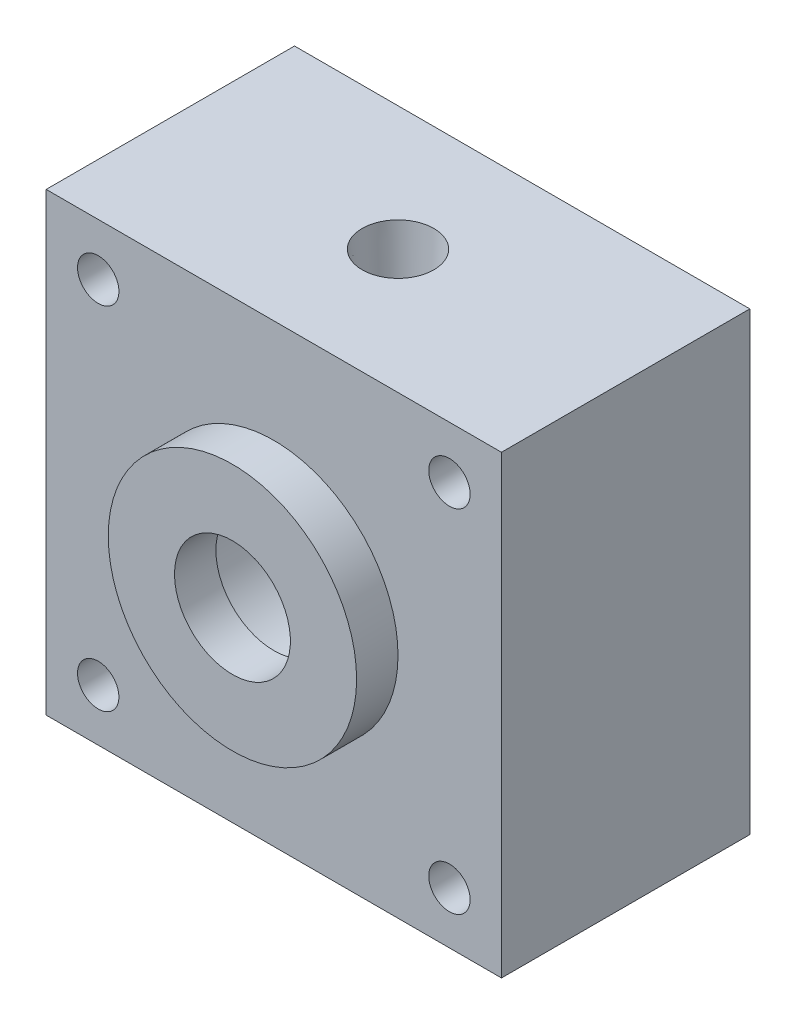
ISO-10303-21;
HEADER;
FILE_DESCRIPTION(('STEP AP214'),'2;1');
FILE_NAME('part.step','',(''),(''),'','','');
FILE_SCHEMA(('AUTOMOTIVE_DESIGN { 1 0 10303 214 1 1 1 1 }'));
ENDSEC;
DATA;
#1=APPLICATION_CONTEXT('core data for automotive mechanical design processes');
#2=APPLICATION_PROTOCOL_DEFINITION('international standard','automotive_design',2000,#1);
#3=PRODUCT_CONTEXT('',#1,'mechanical');
#4=PRODUCT('Part','Part','',(#3));
#5=PRODUCT_RELATED_PRODUCT_CATEGORY('part','',(#4));
#6=PRODUCT_DEFINITION_FORMATION('','',#4);
#7=PRODUCT_DEFINITION_CONTEXT('part definition',#1,'design');
#8=PRODUCT_DEFINITION('design','',#6,#7);
#9=PRODUCT_DEFINITION_SHAPE('','',#8);
#10=(LENGTH_UNIT() NAMED_UNIT(*) SI_UNIT(.MILLI.,.METRE.));
#11=(NAMED_UNIT(*) PLANE_ANGLE_UNIT() SI_UNIT($,.RADIAN.));
#12=(NAMED_UNIT(*) SI_UNIT($,.STERADIAN.) SOLID_ANGLE_UNIT());
#13=UNCERTAINTY_MEASURE_WITH_UNIT(LENGTH_MEASURE(1.E-05),#10,'distance_accuracy_value','');
#14=(GEOMETRIC_REPRESENTATION_CONTEXT(3) GLOBAL_UNCERTAINTY_ASSIGNED_CONTEXT((#13)) GLOBAL_UNIT_ASSIGNED_CONTEXT((#10,
#11,#12)) REPRESENTATION_CONTEXT('',''));
#15=CARTESIAN_POINT('',(0.,0.,0.));
#16=DIRECTION('',(0.,0.,1.));
#17=DIRECTION('',(1.,0.,0.));
#18=AXIS2_PLACEMENT_3D('',#15,#16,#17);
#19=CARTESIAN_POINT('',(0.,0.,22.225));
#20=DIRECTION('',(0.,0.,-1.));
#21=DIRECTION('',(-1.,0.,0.));
#22=AXIS2_PLACEMENT_3D('',#19,#20,#21);
#23=CYLINDRICAL_SURFACE('',#22,4.445);
#24=CARTESIAN_POINT('',(0.,0.,22.225));
#25=DIRECTION('',(0.,0.,-1.));
#26=DIRECTION('',(-1.,0.,0.));
#27=AXIS2_PLACEMENT_3D('',#24,#25,#26);
#28=CIRCLE('',#27,4.445);
#29=CARTESIAN_POINT('',(-4.445,0.,22.225));
#30=VERTEX_POINT('',#29);
#31=EDGE_CURVE('E114',#30,#30,#28,.T.);
#32=ORIENTED_EDGE('',*,*,#31,.F.);
#33=EDGE_LOOP('',(#32));
#34=FACE_BOUND('',#33,.T.);
#35=CARTESIAN_POINT('',(0.,0.,19.05));
#36=DIRECTION('',(0.,0.,-1.));
#37=DIRECTION('',(-1.,0.,0.));
#38=AXIS2_PLACEMENT_3D('',#35,#36,#37);
#39=CIRCLE('',#38,4.445);
#40=CARTESIAN_POINT('',(-4.445,0.,19.05));
#41=VERTEX_POINT('',#40);
#42=EDGE_CURVE('E112',#41,#41,#39,.F.);
#43=ORIENTED_EDGE('',*,*,#42,.F.);
#44=EDGE_LOOP('',(#43));
#45=FACE_BOUND('',#44,.T.);
#46=ADVANCED_FACE('F28',(#34,#45),#23,.F.);
#47=CARTESIAN_POINT('',(-17.4625,-17.4625,19.05));
#48=DIRECTION('',(0.,0.,-1.));
#49=DIRECTION('',(-1.,0.,0.));
#50=AXIS2_PLACEMENT_3D('',#47,#48,#49);
#51=PLANE('',#50);
#52=DIRECTION('',(0.,-1.,0.));
#53=VECTOR('',#52,1.);
#54=CARTESIAN_POINT('',(-17.4625,17.4625,19.05));
#55=LINE('',#54,#53);
#56=CARTESIAN_POINT('',(-17.4625,17.4625,19.05));
#57=VERTEX_POINT('',#56);
#58=CARTESIAN_POINT('',(-17.4625,-17.4625,19.05));
#59=VERTEX_POINT('',#58);
#60=EDGE_CURVE('E103',#57,#59,#55,.T.);
#61=ORIENTED_EDGE('',*,*,#60,.T.);
#62=DIRECTION('',(-1.,0.,0.));
#63=VECTOR('',#62,1.);
#64=CARTESIAN_POINT('',(17.4625,-17.4625,19.05));
#65=LINE('',#64,#63);
#66=CARTESIAN_POINT('',(17.4625,-17.4625,19.05));
#67=VERTEX_POINT('',#66);
#68=EDGE_CURVE('E83',#67,#59,#65,.T.);
#69=ORIENTED_EDGE('',*,*,#68,.F.);
#70=DIRECTION('',(0.,1.,0.));
#71=VECTOR('',#70,1.);
#72=CARTESIAN_POINT('',(17.4625,-17.4625,19.05));
#73=LINE('',#72,#71);
#74=CARTESIAN_POINT('',(17.4625,17.4625,19.05));
#75=VERTEX_POINT('',#74);
#76=EDGE_CURVE('E57',#67,#75,#73,.T.);
#77=ORIENTED_EDGE('',*,*,#76,.T.);
#78=DIRECTION('',(1.,0.,0.));
#79=VECTOR('',#78,1.);
#80=CARTESIAN_POINT('',(-17.4625,17.4625,19.05));
#81=LINE('',#80,#79);
#82=EDGE_CURVE('E107',#57,#75,#81,.T.);
#83=ORIENTED_EDGE('',*,*,#82,.F.);
#84=EDGE_LOOP('',(#61,#69,#77,#83));
#85=FACE_BOUND('',#84,.T.);
#86=CARTESIAN_POINT('',(13.4703841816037,13.4703841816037,19.05));
#87=DIRECTION('',(0.,0.,1.));
#88=DIRECTION('',(1.,0.,0.));
#89=AXIS2_PLACEMENT_3D('',#86,#87,#88);
#90=CIRCLE('',#89,1.5875);
#91=CARTESIAN_POINT('',(15.0578841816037,13.4703841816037,19.05));
#92=VERTEX_POINT('',#91);
#93=EDGE_CURVE('E160',#92,#92,#90,.T.);
#94=ORIENTED_EDGE('',*,*,#93,.F.);
#95=EDGE_LOOP('',(#94));
#96=FACE_BOUND('',#95,.T.);
#97=CARTESIAN_POINT('',(13.4703841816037,-13.4703841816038,19.05));
#98=DIRECTION('',(0.,0.,1.));
#99=DIRECTION('',(0.,-1.,0.));
#100=AXIS2_PLACEMENT_3D('',#97,#98,#99);
#101=CIRCLE('',#100,1.5875);
#102=CARTESIAN_POINT('',(13.4703841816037,-15.0578841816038,19.05));
#103=VERTEX_POINT('',#102);
#104=EDGE_CURVE('E157',#103,#103,#101,.T.);
#105=ORIENTED_EDGE('',*,*,#104,.F.);
#106=EDGE_LOOP('',(#105));
#107=FACE_BOUND('',#106,.T.);
#108=CARTESIAN_POINT('',(-13.4703841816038,-13.4703841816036,19.05));
#109=DIRECTION('',(0.,0.,1.));
#110=DIRECTION('',(-1.,0.,0.));
#111=AXIS2_PLACEMENT_3D('',#108,#109,#110);
#112=CIRCLE('',#111,1.5875);
#113=CARTESIAN_POINT('',(-15.0578841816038,-13.4703841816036,19.05));
#114=VERTEX_POINT('',#113);
#115=EDGE_CURVE('E151',#114,#114,#112,.T.);
#116=ORIENTED_EDGE('',*,*,#115,.F.);
#117=EDGE_LOOP('',(#116));
#118=FACE_BOUND('',#117,.T.);
#119=CARTESIAN_POINT('',(-13.4703841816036,13.4703841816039,19.05));
#120=DIRECTION('',(0.,0.,1.));
#121=DIRECTION('',(0.,1.,0.));
#122=AXIS2_PLACEMENT_3D('',#119,#120,#121);
#123=CIRCLE('',#122,1.5875);
#124=CARTESIAN_POINT('',(-13.4703841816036,15.0578841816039,19.05));
#125=VERTEX_POINT('',#124);
#126=EDGE_CURVE('E145',#125,#125,#123,.T.);
#127=ORIENTED_EDGE('',*,*,#126,.F.);
#128=EDGE_LOOP('',(#127));
#129=FACE_BOUND('',#128,.T.);
#130=CARTESIAN_POINT('',(0.,0.,19.05));
#131=DIRECTION('',(0.,0.,-1.));
#132=DIRECTION('',(-1.,0.,0.));
#133=AXIS2_PLACEMENT_3D('',#130,#131,#132);
#134=CIRCLE('',#133,9.525);
#135=CARTESIAN_POINT('',(-9.525,0.,19.05));
#136=VERTEX_POINT('',#135);
#137=EDGE_CURVE('E11',#136,#136,#134,.F.);
#138=ORIENTED_EDGE('',*,*,#137,.F.);
#139=EDGE_LOOP('',(#138));
#140=FACE_BOUND('',#139,.T.);
#141=ADVANCED_FACE('F204',(#85,#96,#107,#118,#129,#140),#51,.F.);
#142=CARTESIAN_POINT('',(-17.4625,17.4625,19.05));
#143=DIRECTION('',(0.,1.,0.));
#144=DIRECTION('',(0.,0.,1.));
#145=AXIS2_PLACEMENT_3D('',#142,#143,#144);
#146=PLANE('',#145);
#147=DIRECTION('',(1.,0.,0.));
#148=VECTOR('',#147,1.);
#149=CARTESIAN_POINT('',(-17.4625,17.4625,0.));
#150=LINE('',#149,#148);
#151=CARTESIAN_POINT('',(-17.4625,17.4625,0.));
#152=VERTEX_POINT('',#151);
#153=CARTESIAN_POINT('',(17.4625,17.4625,0.));
#154=VERTEX_POINT('',#153);
#155=EDGE_CURVE('E98',#152,#154,#150,.T.);
#156=ORIENTED_EDGE('',*,*,#155,.F.);
#157=DIRECTION('',(0.,0.,-1.));
#158=VECTOR('',#157,1.);
#159=CARTESIAN_POINT('',(-17.4625,17.4625,19.05));
#160=LINE('',#159,#158);
#161=EDGE_CURVE('E49',#57,#152,#160,.T.);
#162=ORIENTED_EDGE('',*,*,#161,.F.);
#163=ORIENTED_EDGE('',*,*,#82,.T.);
#164=DIRECTION('',(0.,0.,-1.));
#165=VECTOR('',#164,1.);
#166=CARTESIAN_POINT('',(17.4625,17.4625,19.05));
#167=LINE('',#166,#165);
#168=EDGE_CURVE('E110',#75,#154,#167,.T.);
#169=ORIENTED_EDGE('',*,*,#168,.T.);
#170=EDGE_LOOP('',(#156,#162,#163,#169));
#171=FACE_BOUND('',#170,.T.);
#172=CARTESIAN_POINT('',(0.,17.4625000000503,9.525));
#173=DIRECTION('',(0.,1.,0.));
#174=DIRECTION('',(0.,0.,1.));
#175=AXIS2_PLACEMENT_3D('',#172,#173,#174);
#176=CIRCLE('',#175,2.75046679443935);
#177=CARTESIAN_POINT('',(0.,17.4625000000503,12.2754667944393));
#178=VERTEX_POINT('',#177);
#179=EDGE_CURVE('E133',#178,#178,#176,.T.);
#180=ORIENTED_EDGE('',*,*,#179,.F.);
#181=EDGE_LOOP('',(#180));
#182=FACE_BOUND('',#181,.T.);
#183=ADVANCED_FACE('F211',(#171,#182),#146,.T.);
#184=CARTESIAN_POINT('',(-17.4625,17.4625,19.05));
#185=DIRECTION('',(1.,0.,0.));
#186=DIRECTION('',(0.,1.,0.));
#187=AXIS2_PLACEMENT_3D('',#184,#185,#186);
#188=PLANE('',#187);
#189=DIRECTION('',(0.,-1.,0.));
#190=VECTOR('',#189,1.);
#191=CARTESIAN_POINT('',(-17.4625,17.4625,0.));
#192=LINE('',#191,#190);
#193=CARTESIAN_POINT('',(-17.4625,-17.4625,0.));
#194=VERTEX_POINT('',#193);
#195=EDGE_CURVE('E88',#152,#194,#192,.T.);
#196=ORIENTED_EDGE('',*,*,#195,.T.);
#197=DIRECTION('',(0.,0.,-1.));
#198=VECTOR('',#197,1.);
#199=CARTESIAN_POINT('',(-17.4625,-17.4625,19.05));
#200=LINE('',#199,#198);
#201=EDGE_CURVE('E41',#59,#194,#200,.T.);
#202=ORIENTED_EDGE('',*,*,#201,.F.);
#203=ORIENTED_EDGE('',*,*,#60,.F.);
#204=ORIENTED_EDGE('',*,*,#161,.T.);
#205=EDGE_LOOP('',(#196,#202,#203,#204));
#206=FACE_BOUND('',#205,.T.);
#207=ADVANCED_FACE('F30',(#206),#188,.F.);
#208=CARTESIAN_POINT('',(17.4625,-17.4625,19.05));
#209=DIRECTION('',(0.,-1.,0.));
#210=DIRECTION('',(0.,0.,-1.));
#211=AXIS2_PLACEMENT_3D('',#208,#209,#210);
#212=PLANE('',#211);
#213=DIRECTION('',(-1.,0.,0.));
#214=VECTOR('',#213,1.);
#215=CARTESIAN_POINT('',(17.4625,-17.4625,0.));
#216=LINE('',#215,#214);
#217=CARTESIAN_POINT('',(17.4625,-17.4625,0.));
#218=VERTEX_POINT('',#217);
#219=EDGE_CURVE('E82',#218,#194,#216,.T.);
#220=ORIENTED_EDGE('',*,*,#219,.F.);
#221=DIRECTION('',(0.,0.,-1.));
#222=VECTOR('',#221,1.);
#223=CARTESIAN_POINT('',(17.4625,-17.4625,19.05));
#224=LINE('',#223,#222);
#225=EDGE_CURVE('E85',#67,#218,#224,.T.);
#226=ORIENTED_EDGE('',*,*,#225,.F.);
#227=ORIENTED_EDGE('',*,*,#68,.T.);
#228=ORIENTED_EDGE('',*,*,#201,.T.);
#229=EDGE_LOOP('',(#220,#226,#227,#228));
#230=FACE_BOUND('',#229,.T.);
#231=ADVANCED_FACE('F80',(#230),#212,.T.);
#232=CARTESIAN_POINT('',(17.4625,-17.4625,19.05));
#233=DIRECTION('',(-1.,0.,0.));
#234=DIRECTION('',(0.,0.,1.));
#235=AXIS2_PLACEMENT_3D('',#232,#233,#234);
#236=PLANE('',#235);
#237=DIRECTION('',(0.,1.,0.));
#238=VECTOR('',#237,1.);
#239=CARTESIAN_POINT('',(17.4625,-17.4625,0.));
#240=LINE('',#239,#238);
#241=EDGE_CURVE('E96',#218,#154,#240,.T.);
#242=ORIENTED_EDGE('',*,*,#241,.T.);
#243=ORIENTED_EDGE('',*,*,#168,.F.);
#244=ORIENTED_EDGE('',*,*,#76,.F.);
#245=ORIENTED_EDGE('',*,*,#225,.T.);
#246=EDGE_LOOP('',(#242,#243,#244,#245));
#247=FACE_BOUND('',#246,.T.);
#248=ADVANCED_FACE('F186',(#247),#236,.F.);
#249=CARTESIAN_POINT('',(-17.4625,-17.4625,0.));
#250=DIRECTION('',(0.,0.,-1.));
#251=DIRECTION('',(-1.,0.,0.));
#252=AXIS2_PLACEMENT_3D('',#249,#250,#251);
#253=PLANE('',#252);
#254=CARTESIAN_POINT('',(-13.4703841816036,13.4703841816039,0.));
#255=DIRECTION('',(0.,0.,1.));
#256=DIRECTION('',(0.,1.,0.));
#257=AXIS2_PLACEMENT_3D('',#254,#255,#256);
#258=CIRCLE('',#257,1.5875);
#259=CARTESIAN_POINT('',(-13.4703841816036,15.0578841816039,0.));
#260=VERTEX_POINT('',#259);
#261=EDGE_CURVE('E142',#260,#260,#258,.T.);
#262=ORIENTED_EDGE('',*,*,#261,.T.);
#263=EDGE_LOOP('',(#262));
#264=FACE_BOUND('',#263,.T.);
#265=CARTESIAN_POINT('',(-13.4703841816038,-13.4703841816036,0.));
#266=DIRECTION('',(0.,0.,1.));
#267=DIRECTION('',(-1.,0.,0.));
#268=AXIS2_PLACEMENT_3D('',#265,#266,#267);
#269=CIRCLE('',#268,1.5875);
#270=CARTESIAN_POINT('',(-15.0578841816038,-13.4703841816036,0.));
#271=VERTEX_POINT('',#270);
#272=EDGE_CURVE('E148',#271,#271,#269,.T.);
#273=ORIENTED_EDGE('',*,*,#272,.T.);
#274=EDGE_LOOP('',(#273));
#275=FACE_BOUND('',#274,.T.);
#276=CARTESIAN_POINT('',(13.4703841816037,-13.4703841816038,0.));
#277=DIRECTION('',(0.,0.,1.));
#278=DIRECTION('',(0.,-1.,0.));
#279=AXIS2_PLACEMENT_3D('',#276,#277,#278);
#280=CIRCLE('',#279,1.5875);
#281=CARTESIAN_POINT('',(13.4703841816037,-15.0578841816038,0.));
#282=VERTEX_POINT('',#281);
#283=EDGE_CURVE('E154',#282,#282,#280,.T.);
#284=ORIENTED_EDGE('',*,*,#283,.T.);
#285=EDGE_LOOP('',(#284));
#286=FACE_BOUND('',#285,.T.);
#287=CARTESIAN_POINT('',(13.4703841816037,13.4703841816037,0.));
#288=DIRECTION('',(0.,0.,1.));
#289=DIRECTION('',(1.,0.,0.));
#290=AXIS2_PLACEMENT_3D('',#287,#288,#289);
#291=CIRCLE('',#290,1.5875);
#292=CARTESIAN_POINT('',(15.0578841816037,13.4703841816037,0.));
#293=VERTEX_POINT('',#292);
#294=EDGE_CURVE('E163',#293,#293,#291,.T.);
#295=ORIENTED_EDGE('',*,*,#294,.T.);
#296=EDGE_LOOP('',(#295));
#297=FACE_BOUND('',#296,.T.);
#298=CARTESIAN_POINT('',(0.,0.,5.6843418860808E-11));
#299=DIRECTION('',(0.,0.,-1.));
#300=DIRECTION('',(-1.,0.,0.));
#301=AXIS2_PLACEMENT_3D('',#298,#299,#300);
#302=CIRCLE('',#301,15.875);
#303=CARTESIAN_POINT('',(-15.875,0.,5.6843418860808E-11));
#304=VERTEX_POINT('',#303);
#305=EDGE_CURVE('E172',#304,#304,#302,.T.);
#306=ORIENTED_EDGE('',*,*,#305,.F.);
#307=EDGE_LOOP('',(#306));
#308=FACE_BOUND('',#307,.T.);
#309=ORIENTED_EDGE('',*,*,#195,.F.);
#310=ORIENTED_EDGE('',*,*,#155,.T.);
#311=ORIENTED_EDGE('',*,*,#241,.F.);
#312=ORIENTED_EDGE('',*,*,#219,.T.);
#313=EDGE_LOOP('',(#309,#310,#311,#312));
#314=FACE_BOUND('',#313,.T.);
#315=ADVANCED_FACE('F94',(#264,#275,#286,#297,#308,#314),#253,.T.);
#316=CARTESIAN_POINT('',(0.,0.,1.52400000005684));
#317=DIRECTION('',(0.,0.,-1.));
#318=DIRECTION('',(-1.,0.,0.));
#319=AXIS2_PLACEMENT_3D('',#316,#317,#318);
#320=CYLINDRICAL_SURFACE('',#319,15.875);
#321=CARTESIAN_POINT('',(0.,0.,1.52400000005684));
#322=DIRECTION('',(0.,0.,-1.));
#323=DIRECTION('',(-1.,0.,0.));
#324=AXIS2_PLACEMENT_3D('',#321,#322,#323);
#325=CIRCLE('',#324,15.875);
#326=CARTESIAN_POINT('',(-15.875,0.,1.52400000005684));
#327=VERTEX_POINT('',#326);
#328=EDGE_CURVE('E91',#327,#327,#325,.T.);
#329=CARTESIAN_POINT('',(-15.875,0.,1.52400000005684));
#330=CARTESIAN_POINT('',(-15.875,0.,1.50812500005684));
#331=CARTESIAN_POINT('',(-15.875,0.,1.49225000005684));
#332=CARTESIAN_POINT('',(-15.875,0.,1.46050000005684));
#333=CARTESIAN_POINT('',(-15.875,0.,1.44462500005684));
#334=CARTESIAN_POINT('',(-15.875,0.,1.41287500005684));
#335=CARTESIAN_POINT('',(-15.875,0.,1.39700000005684));
#336=CARTESIAN_POINT('',(-15.875,0.,1.36525000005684));
#337=CARTESIAN_POINT('',(-15.875,0.,1.34937500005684));
#338=CARTESIAN_POINT('',(-15.875,0.,1.31762500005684));
#339=CARTESIAN_POINT('',(-15.875,0.,1.30175000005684));
#340=CARTESIAN_POINT('',(-15.875,0.,1.27000000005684));
#341=CARTESIAN_POINT('',(-15.875,0.,1.25412500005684));
#342=CARTESIAN_POINT('',(-15.875,0.,1.22237500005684));
#343=CARTESIAN_POINT('',(-15.875,0.,1.20650000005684));
#344=CARTESIAN_POINT('',(-15.875,0.,1.17475000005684));
#345=CARTESIAN_POINT('',(-15.875,0.,1.15887500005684));
#346=CARTESIAN_POINT('',(-15.875,0.,1.12712500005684));
#347=CARTESIAN_POINT('',(-15.875,0.,1.11125000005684));
#348=CARTESIAN_POINT('',(-15.875,0.,1.07950000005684));
#349=CARTESIAN_POINT('',(-15.875,0.,1.06362500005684));
#350=CARTESIAN_POINT('',(-15.875,0.,1.03187500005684));
#351=CARTESIAN_POINT('',(-15.875,0.,1.01600000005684));
#352=CARTESIAN_POINT('',(-15.875,0.,0.984250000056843));
#353=CARTESIAN_POINT('',(-15.875,0.,0.968375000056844));
#354=CARTESIAN_POINT('',(-15.875,0.,0.936625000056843));
#355=CARTESIAN_POINT('',(-15.875,0.,0.920750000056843));
#356=CARTESIAN_POINT('',(-15.875,0.,0.889000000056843));
#357=CARTESIAN_POINT('',(-15.875,0.,0.873125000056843));
#358=CARTESIAN_POINT('',(-15.875,0.,0.841375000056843));
#359=CARTESIAN_POINT('',(-15.875,0.,0.825500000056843));
#360=CARTESIAN_POINT('',(-15.875,0.,0.793750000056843));
#361=CARTESIAN_POINT('',(-15.875,0.,0.777875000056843));
#362=CARTESIAN_POINT('',(-15.875,0.,0.746125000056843));
#363=CARTESIAN_POINT('',(-15.875,0.,0.730250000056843));
#364=CARTESIAN_POINT('',(-15.875,0.,0.698500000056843));
#365=CARTESIAN_POINT('',(-15.875,0.,0.682625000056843));
#366=CARTESIAN_POINT('',(-15.875,0.,0.650875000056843));
#367=CARTESIAN_POINT('',(-15.875,0.,0.635000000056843));
#368=CARTESIAN_POINT('',(-15.875,0.,0.603250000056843));
#369=CARTESIAN_POINT('',(-15.875,0.,0.587375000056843));
#370=CARTESIAN_POINT('',(-15.875,0.,0.555625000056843));
#371=CARTESIAN_POINT('',(-15.875,0.,0.539750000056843));
#372=CARTESIAN_POINT('',(-15.875,0.,0.508000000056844));
#373=CARTESIAN_POINT('',(-15.875,0.,0.492125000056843));
#374=CARTESIAN_POINT('',(-15.875,0.,0.460375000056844));
#375=CARTESIAN_POINT('',(-15.875,0.,0.444500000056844));
#376=CARTESIAN_POINT('',(-15.875,0.,0.412750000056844));
#377=CARTESIAN_POINT('',(-15.875,0.,0.396875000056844));
#378=CARTESIAN_POINT('',(-15.875,0.,0.365125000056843));
#379=CARTESIAN_POINT('',(-15.875,0.,0.349250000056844));
#380=CARTESIAN_POINT('',(-15.875,0.,0.317500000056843));
#381=CARTESIAN_POINT('',(-15.875,0.,0.301625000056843));
#382=CARTESIAN_POINT('',(-15.875,0.,0.269875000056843));
#383=CARTESIAN_POINT('',(-15.875,0.,0.254000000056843));
#384=CARTESIAN_POINT('',(-15.875,0.,0.222250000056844));
#385=CARTESIAN_POINT('',(-15.875,0.,0.206375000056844));
#386=CARTESIAN_POINT('',(-15.875,0.,0.174625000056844));
#387=CARTESIAN_POINT('',(-15.875,0.,0.158750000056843));
#388=CARTESIAN_POINT('',(-15.875,0.,0.127000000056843));
#389=CARTESIAN_POINT('',(-15.875,0.,0.111125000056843));
#390=CARTESIAN_POINT('',(-15.875,0.,0.0793750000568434));
#391=CARTESIAN_POINT('',(-15.875,0.,0.0635000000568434));
#392=CARTESIAN_POINT('',(-15.875,0.,0.0317500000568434));
#393=CARTESIAN_POINT('',(-15.875,0.,0.0158750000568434));
#394=CARTESIAN_POINT('',(-15.875,0.,5.6843418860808E-11));
#395=B_SPLINE_CURVE_WITH_KNOTS('',3,(#329,#330,#331,#332,#333,#334,#335,#336,#337,#338,#339,
#340,#341,#342,#343,#344,#345,#346,#347,#348,#349,#350,#351,#352,#353,#354,#355,#356,#357,#358,
#359,#360,#361,#362,#363,#364,#365,#366,#367,#368,#369,#370,#371,#372,#373,#374,#375,#376,#377,
#378,#379,#380,#381,#382,#383,#384,#385,#386,#387,#388,#389,#390,#391,#392,#393,#394),
.UNSPECIFIED.,.F.,.F.,(4,2,2,2,2,2,2,2,2,2,2,2,2,2,2,2,2,2,2,2,2,2,2,2,2,2,2,2,2,2,2,2,4),(0.,
0.0476250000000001,0.0952500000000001,0.142875,0.1905,0.238125,0.28575,0.333375,0.381,0.428625,
0.47625,0.523875,0.5715,0.619125,0.66675,0.714375,0.762,0.809625,0.85725,0.904875,0.9525,
1.000125,1.04775,1.095375,1.143,1.190625,1.23825,1.285875,1.3335,1.381125,1.42875,1.476375,
1.524),.UNSPECIFIED.);
#396=EDGE_CURVE('BSEAM179',#327,#304,#395,.T.);
#397=ORIENTED_EDGE('',*,*,#328,.F.);
#398=ORIENTED_EDGE('',*,*,#305,.T.);
#399=ORIENTED_EDGE('',*,*,#396,.T.);
#400=ORIENTED_EDGE('',*,*,#396,.F.);
#401=EDGE_LOOP('',(#397,#399,#398,#400));
#402=FACE_BOUND('',#401,.T.);
#403=ADVANCED_FACE('F179',(#402),#320,.F.);
#404=CARTESIAN_POINT('',(0.,0.,1.52400000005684));
#405=DIRECTION('',(0.,0.,-1.));
#406=DIRECTION('',(-1.,0.,0.));
#407=AXIS2_PLACEMENT_3D('',#404,#405,#406);
#408=PLANE('',#407);
#409=CARTESIAN_POINT('',(0.,0.,1.52400000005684));
#410=DIRECTION('',(0.,0.,-1.));
#411=DIRECTION('',(-1.,0.,0.));
#412=AXIS2_PLACEMENT_3D('',#409,#410,#411);
#413=CIRCLE('',#412,14.2875);
#414=CARTESIAN_POINT('',(-14.2875,0.,1.52400000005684));
#415=VERTEX_POINT('',#414);
#416=EDGE_CURVE('E169',#415,#415,#413,.T.);
#417=ORIENTED_EDGE('',*,*,#416,.F.);
#418=EDGE_LOOP('',(#417));
#419=FACE_BOUND('',#418,.T.);
#420=ORIENTED_EDGE('',*,*,#328,.T.);
#421=EDGE_LOOP('',(#420));
#422=FACE_BOUND('',#421,.T.);
#423=ADVANCED_FACE('F177',(#419,#422),#408,.T.);
#424=CARTESIAN_POINT('',(0.,0.,1.52400000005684));
#425=DIRECTION('',(0.,0.,-1.));
#426=DIRECTION('',(-1.,0.,0.));
#427=AXIS2_PLACEMENT_3D('',#424,#425,#426);
#428=CYLINDRICAL_SURFACE('',#427,14.2875);
#429=CARTESIAN_POINT('',(0.,0.,5.6843418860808E-11));
#430=DIRECTION('',(0.,0.,-1.));
#431=DIRECTION('',(-1.,0.,0.));
#432=AXIS2_PLACEMENT_3D('',#429,#430,#431);
#433=CIRCLE('',#432,14.2875);
#434=CARTESIAN_POINT('',(-14.2875,0.,5.6843418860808E-11));
#435=VERTEX_POINT('',#434);
#436=EDGE_CURVE('E166',#435,#435,#433,.T.);
#437=CARTESIAN_POINT('',(-14.2875,0.,1.52400000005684));
#438=CARTESIAN_POINT('',(-14.2875,0.,1.50812500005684));
#439=CARTESIAN_POINT('',(-14.2875,0.,1.49225000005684));
#440=CARTESIAN_POINT('',(-14.2875,0.,1.46050000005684));
#441=CARTESIAN_POINT('',(-14.2875,0.,1.44462500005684));
#442=CARTESIAN_POINT('',(-14.2875,0.,1.41287500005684));
#443=CARTESIAN_POINT('',(-14.2875,0.,1.39700000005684));
#444=CARTESIAN_POINT('',(-14.2875,0.,1.36525000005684));
#445=CARTESIAN_POINT('',(-14.2875,0.,1.34937500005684));
#446=CARTESIAN_POINT('',(-14.2875,0.,1.31762500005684));
#447=CARTESIAN_POINT('',(-14.2875,0.,1.30175000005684));
#448=CARTESIAN_POINT('',(-14.2875,0.,1.27000000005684));
#449=CARTESIAN_POINT('',(-14.2875,0.,1.25412500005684));
#450=CARTESIAN_POINT('',(-14.2875,0.,1.22237500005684));
#451=CARTESIAN_POINT('',(-14.2875,0.,1.20650000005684));
#452=CARTESIAN_POINT('',(-14.2875,0.,1.17475000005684));
#453=CARTESIAN_POINT('',(-14.2875,0.,1.15887500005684));
#454=CARTESIAN_POINT('',(-14.2875,0.,1.12712500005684));
#455=CARTESIAN_POINT('',(-14.2875,0.,1.11125000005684));
#456=CARTESIAN_POINT('',(-14.2875,0.,1.07950000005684));
#457=CARTESIAN_POINT('',(-14.2875,0.,1.06362500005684));
#458=CARTESIAN_POINT('',(-14.2875,0.,1.03187500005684));
#459=CARTESIAN_POINT('',(-14.2875,0.,1.01600000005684));
#460=CARTESIAN_POINT('',(-14.2875,0.,0.984250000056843));
#461=CARTESIAN_POINT('',(-14.2875,0.,0.968375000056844));
#462=CARTESIAN_POINT('',(-14.2875,0.,0.936625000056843));
#463=CARTESIAN_POINT('',(-14.2875,0.,0.920750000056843));
#464=CARTESIAN_POINT('',(-14.2875,0.,0.889000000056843));
#465=CARTESIAN_POINT('',(-14.2875,0.,0.873125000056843));
#466=CARTESIAN_POINT('',(-14.2875,0.,0.841375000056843));
#467=CARTESIAN_POINT('',(-14.2875,0.,0.825500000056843));
#468=CARTESIAN_POINT('',(-14.2875,0.,0.793750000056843));
#469=CARTESIAN_POINT('',(-14.2875,0.,0.777875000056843));
#470=CARTESIAN_POINT('',(-14.2875,0.,0.746125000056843));
#471=CARTESIAN_POINT('',(-14.2875,0.,0.730250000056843));
#472=CARTESIAN_POINT('',(-14.2875,0.,0.698500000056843));
#473=CARTESIAN_POINT('',(-14.2875,0.,0.682625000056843));
#474=CARTESIAN_POINT('',(-14.2875,0.,0.650875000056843));
#475=CARTESIAN_POINT('',(-14.2875,0.,0.635000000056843));
#476=CARTESIAN_POINT('',(-14.2875,0.,0.603250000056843));
#477=CARTESIAN_POINT('',(-14.2875,0.,0.587375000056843));
#478=CARTESIAN_POINT('',(-14.2875,0.,0.555625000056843));
#479=CARTESIAN_POINT('',(-14.2875,0.,0.539750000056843));
#480=CARTESIAN_POINT('',(-14.2875,0.,0.508000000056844));
#481=CARTESIAN_POINT('',(-14.2875,0.,0.492125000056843));
#482=CARTESIAN_POINT('',(-14.2875,0.,0.460375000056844));
#483=CARTESIAN_POINT('',(-14.2875,0.,0.444500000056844));
#484=CARTESIAN_POINT('',(-14.2875,0.,0.412750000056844));
#485=CARTESIAN_POINT('',(-14.2875,0.,0.396875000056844));
#486=CARTESIAN_POINT('',(-14.2875,0.,0.365125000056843));
#487=CARTESIAN_POINT('',(-14.2875,0.,0.349250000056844));
#488=CARTESIAN_POINT('',(-14.2875,0.,0.317500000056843));
#489=CARTESIAN_POINT('',(-14.2875,0.,0.301625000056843));
#490=CARTESIAN_POINT('',(-14.2875,0.,0.269875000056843));
#491=CARTESIAN_POINT('',(-14.2875,0.,0.254000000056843));
#492=CARTESIAN_POINT('',(-14.2875,0.,0.222250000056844));
#493=CARTESIAN_POINT('',(-14.2875,0.,0.206375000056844));
#494=CARTESIAN_POINT('',(-14.2875,0.,0.174625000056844));
#495=CARTESIAN_POINT('',(-14.2875,0.,0.158750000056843));
#496=CARTESIAN_POINT('',(-14.2875,0.,0.127000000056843));
#497=CARTESIAN_POINT('',(-14.2875,0.,0.111125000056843));
#498=CARTESIAN_POINT('',(-14.2875,0.,0.0793750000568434));
#499=CARTESIAN_POINT('',(-14.2875,0.,0.0635000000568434));
#500=CARTESIAN_POINT('',(-14.2875,0.,0.0317500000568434));
#501=CARTESIAN_POINT('',(-14.2875,0.,0.0158750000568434));
#502=CARTESIAN_POINT('',(-14.2875,0.,5.6843418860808E-11));
#503=B_SPLINE_CURVE_WITH_KNOTS('',3,(#437,#438,#439,#440,#441,#442,#443,#444,#445,#446,#447,
#448,#449,#450,#451,#452,#453,#454,#455,#456,#457,#458,#459,#460,#461,#462,#463,#464,#465,#466,
#467,#468,#469,#470,#471,#472,#473,#474,#475,#476,#477,#478,#479,#480,#481,#482,#483,#484,#485,
#486,#487,#488,#489,#490,#491,#492,#493,#494,#495,#496,#497,#498,#499,#500,#501,#502),
.UNSPECIFIED.,.F.,.F.,(4,2,2,2,2,2,2,2,2,2,2,2,2,2,2,2,2,2,2,2,2,2,2,2,2,2,2,2,2,2,2,2,4),(0.,
0.0476250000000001,0.0952500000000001,0.142875,0.1905,0.238125,0.28575,0.333375,0.381,0.428625,
0.47625,0.523875,0.5715,0.619125,0.66675,0.714375,0.762,0.809625,0.85725,0.904875,0.9525,
1.000125,1.04775,1.095375,1.143,1.190625,1.23825,1.285875,1.3335,1.381125,1.42875,1.476375,
1.524),.UNSPECIFIED.);
#504=EDGE_CURVE('BSEAM201',#415,#435,#503,.T.);
#505=ORIENTED_EDGE('',*,*,#416,.T.);
#506=ORIENTED_EDGE('',*,*,#436,.F.);
#507=ORIENTED_EDGE('',*,*,#504,.T.);
#508=ORIENTED_EDGE('',*,*,#504,.F.);
#509=EDGE_LOOP('',(#505,#507,#506,#508));
#510=FACE_BOUND('',#509,.T.);
#511=ADVANCED_FACE('F201',(#510),#428,.T.);
#512=CARTESIAN_POINT('',(0.,0.,0.));
#513=DIRECTION('',(0.,0.,-1.));
#514=DIRECTION('',(-1.,0.,0.));
#515=AXIS2_PLACEMENT_3D('',#512,#513,#514);
#516=CIRCLE('',#515,6.35);
#517=CARTESIAN_POINT('',(-6.35,0.,0.));
#518=VERTEX_POINT('',#517);
#519=EDGE_CURVE('E122',#518,#518,#516,.T.);
#520=ORIENTED_EDGE('',*,*,#519,.F.);
#521=EDGE_LOOP('',(#520));
#522=FACE_BOUND('',#521,.T.);
#523=ORIENTED_EDGE('',*,*,#436,.T.);
#524=EDGE_LOOP('',(#523));
#525=FACE_BOUND('',#524,.T.);
#526=ADVANCED_FACE('F189',(#522,#525),#253,.T.);
#527=CARTESIAN_POINT('',(13.4703841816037,13.4703841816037,0.));
#528=DIRECTION('',(0.,0.,1.));
#529=DIRECTION('',(1.,0.,0.));
#530=AXIS2_PLACEMENT_3D('',#527,#528,#529);
#531=CYLINDRICAL_SURFACE('',#530,1.5875);
#532=CARTESIAN_POINT('',(15.0578841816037,13.4703841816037,0.));
#533=CARTESIAN_POINT('',(15.0578841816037,13.4703841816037,0.1984375));
#534=CARTESIAN_POINT('',(15.0578841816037,13.4703841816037,0.396875));
#535=CARTESIAN_POINT('',(15.0578841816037,13.4703841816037,0.79375));
#536=CARTESIAN_POINT('',(15.0578841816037,13.4703841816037,0.9921875));
#537=CARTESIAN_POINT('',(15.0578841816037,13.4703841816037,1.3890625));
#538=CARTESIAN_POINT('',(15.0578841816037,13.4703841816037,1.5875));
#539=CARTESIAN_POINT('',(15.0578841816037,13.4703841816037,1.984375));
#540=CARTESIAN_POINT('',(15.0578841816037,13.4703841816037,2.1828125));
#541=CARTESIAN_POINT('',(15.0578841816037,13.4703841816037,2.5796875));
#542=CARTESIAN_POINT('',(15.0578841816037,13.4703841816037,2.778125));
#543=CARTESIAN_POINT('',(15.0578841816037,13.4703841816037,3.175));
#544=CARTESIAN_POINT('',(15.0578841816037,13.4703841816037,3.3734375));
#545=CARTESIAN_POINT('',(15.0578841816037,13.4703841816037,3.7703125));
#546=CARTESIAN_POINT('',(15.0578841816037,13.4703841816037,3.96875));
#547=CARTESIAN_POINT('',(15.0578841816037,13.4703841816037,4.365625));
#548=CARTESIAN_POINT('',(15.0578841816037,13.4703841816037,4.5640625));
#549=CARTESIAN_POINT('',(15.0578841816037,13.4703841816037,4.9609375));
#550=CARTESIAN_POINT('',(15.0578841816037,13.4703841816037,5.159375));
#551=CARTESIAN_POINT('',(15.0578841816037,13.4703841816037,5.55625));
#552=CARTESIAN_POINT('',(15.0578841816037,13.4703841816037,5.7546875));
#553=CARTESIAN_POINT('',(15.0578841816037,13.4703841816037,6.1515625));
#554=CARTESIAN_POINT('',(15.0578841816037,13.4703841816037,6.35));
#555=CARTESIAN_POINT('',(15.0578841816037,13.4703841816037,6.746875));
#556=CARTESIAN_POINT('',(15.0578841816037,13.4703841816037,6.9453125));
#557=CARTESIAN_POINT('',(15.0578841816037,13.4703841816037,7.3421875));
#558=CARTESIAN_POINT('',(15.0578841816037,13.4703841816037,7.540625));
#559=CARTESIAN_POINT('',(15.0578841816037,13.4703841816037,7.9375));
#560=CARTESIAN_POINT('',(15.0578841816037,13.4703841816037,8.1359375));
#561=CARTESIAN_POINT('',(15.0578841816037,13.4703841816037,8.5328125));
#562=CARTESIAN_POINT('',(15.0578841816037,13.4703841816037,8.73125));
#563=CARTESIAN_POINT('',(15.0578841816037,13.4703841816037,9.128125));
#564=CARTESIAN_POINT('',(15.0578841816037,13.4703841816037,9.3265625));
#565=CARTESIAN_POINT('',(15.0578841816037,13.4703841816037,9.7234375));
#566=CARTESIAN_POINT('',(15.0578841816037,13.4703841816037,9.921875));
#567=CARTESIAN_POINT('',(15.0578841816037,13.4703841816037,10.31875));
#568=CARTESIAN_POINT('',(15.0578841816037,13.4703841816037,10.5171875));
#569=CARTESIAN_POINT('',(15.0578841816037,13.4703841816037,10.9140625));
#570=CARTESIAN_POINT('',(15.0578841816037,13.4703841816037,11.1125));
#571=CARTESIAN_POINT('',(15.0578841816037,13.4703841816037,11.509375));
#572=CARTESIAN_POINT('',(15.0578841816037,13.4703841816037,11.7078125));
#573=CARTESIAN_POINT('',(15.0578841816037,13.4703841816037,12.1046875));
#574=CARTESIAN_POINT('',(15.0578841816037,13.4703841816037,12.303125));
#575=CARTESIAN_POINT('',(15.0578841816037,13.4703841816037,12.7));
#576=CARTESIAN_POINT('',(15.0578841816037,13.4703841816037,12.8984375));
#577=CARTESIAN_POINT('',(15.0578841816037,13.4703841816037,13.2953125));
#578=CARTESIAN_POINT('',(15.0578841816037,13.4703841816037,13.49375));
#579=CARTESIAN_POINT('',(15.0578841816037,13.4703841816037,13.890625));
#580=CARTESIAN_POINT('',(15.0578841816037,13.4703841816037,14.0890625));
#581=CARTESIAN_POINT('',(15.0578841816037,13.4703841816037,14.4859375));
#582=CARTESIAN_POINT('',(15.0578841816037,13.4703841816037,14.684375));
#583=CARTESIAN_POINT('',(15.0578841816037,13.4703841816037,15.08125));
#584=CARTESIAN_POINT('',(15.0578841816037,13.4703841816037,15.2796875));
#585=CARTESIAN_POINT('',(15.0578841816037,13.4703841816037,15.6765625));
#586=CARTESIAN_POINT('',(15.0578841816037,13.4703841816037,15.875));
#587=CARTESIAN_POINT('',(15.0578841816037,13.4703841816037,16.271875));
#588=CARTESIAN_POINT('',(15.0578841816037,13.4703841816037,16.4703125));
#589=CARTESIAN_POINT('',(15.0578841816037,13.4703841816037,16.8671875));
#590=CARTESIAN_POINT('',(15.0578841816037,13.4703841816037,17.065625));
#591=CARTESIAN_POINT('',(15.0578841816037,13.4703841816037,17.4625));
#592=CARTESIAN_POINT('',(15.0578841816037,13.4703841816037,17.6609375));
#593=CARTESIAN_POINT('',(15.0578841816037,13.4703841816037,18.0578125));
#594=CARTESIAN_POINT('',(15.0578841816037,13.4703841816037,18.25625));
#595=CARTESIAN_POINT('',(15.0578841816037,13.4703841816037,18.653125));
#596=CARTESIAN_POINT('',(15.0578841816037,13.4703841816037,18.8515625));
#597=CARTESIAN_POINT('',(15.0578841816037,13.4703841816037,19.05));
#598=B_SPLINE_CURVE_WITH_KNOTS('',3,(#532,#533,#534,#535,#536,#537,#538,#539,#540,#541,#542,
#543,#544,#545,#546,#547,#548,#549,#550,#551,#552,#553,#554,#555,#556,#557,#558,#559,#560,#561,
#562,#563,#564,#565,#566,#567,#568,#569,#570,#571,#572,#573,#574,#575,#576,#577,#578,#579,#580,
#581,#582,#583,#584,#585,#586,#587,#588,#589,#590,#591,#592,#593,#594,#595,#596,#597),
.UNSPECIFIED.,.F.,.F.,(4,2,2,2,2,2,2,2,2,2,2,2,2,2,2,2,2,2,2,2,2,2,2,2,2,2,2,2,2,2,2,2,4),(0.,
0.5953125,1.190625,1.7859375,2.38125,2.9765625,3.571875,4.1671875,4.7625,5.3578125,5.953125,
6.5484375,7.14375,7.7390625,8.334375,8.9296875,9.525,10.1203125,10.715625,11.3109375,11.90625,
12.5015625,13.096875,13.6921875,14.2875,14.8828125,15.478125,16.0734375,16.66875,17.2640625,
17.859375,18.4546875,19.05),.UNSPECIFIED.);
#599=EDGE_CURVE('BSEAM200',#293,#92,#598,.T.);
#600=ORIENTED_EDGE('',*,*,#294,.F.);
#601=ORIENTED_EDGE('',*,*,#93,.T.);
#602=ORIENTED_EDGE('',*,*,#599,.T.);
#603=ORIENTED_EDGE('',*,*,#599,.F.);
#604=EDGE_LOOP('',(#600,#602,#601,#603));
#605=FACE_BOUND('',#604,.T.);
#606=ADVANCED_FACE('F200',(#605),#531,.F.);
#607=CARTESIAN_POINT('',(13.4703841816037,-13.4703841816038,0.));
#608=DIRECTION('',(0.,0.,1.));
#609=DIRECTION('',(0.,-1.,0.));
#610=AXIS2_PLACEMENT_3D('',#607,#608,#609);
#611=CYLINDRICAL_SURFACE('',#610,1.5875);
#612=CARTESIAN_POINT('',(13.4703841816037,-15.0578841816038,0.));
#613=CARTESIAN_POINT('',(13.4703841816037,-15.0578841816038,0.1984375));
#614=CARTESIAN_POINT('',(13.4703841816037,-15.0578841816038,0.396875));
#615=CARTESIAN_POINT('',(13.4703841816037,-15.0578841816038,0.79375));
#616=CARTESIAN_POINT('',(13.4703841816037,-15.0578841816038,0.9921875));
#617=CARTESIAN_POINT('',(13.4703841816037,-15.0578841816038,1.3890625));
#618=CARTESIAN_POINT('',(13.4703841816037,-15.0578841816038,1.5875));
#619=CARTESIAN_POINT('',(13.4703841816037,-15.0578841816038,1.984375));
#620=CARTESIAN_POINT('',(13.4703841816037,-15.0578841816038,2.1828125));
#621=CARTESIAN_POINT('',(13.4703841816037,-15.0578841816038,2.5796875));
#622=CARTESIAN_POINT('',(13.4703841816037,-15.0578841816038,2.778125));
#623=CARTESIAN_POINT('',(13.4703841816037,-15.0578841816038,3.175));
#624=CARTESIAN_POINT('',(13.4703841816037,-15.0578841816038,3.3734375));
#625=CARTESIAN_POINT('',(13.4703841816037,-15.0578841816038,3.7703125));
#626=CARTESIAN_POINT('',(13.4703841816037,-15.0578841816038,3.96875));
#627=CARTESIAN_POINT('',(13.4703841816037,-15.0578841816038,4.365625));
#628=CARTESIAN_POINT('',(13.4703841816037,-15.0578841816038,4.5640625));
#629=CARTESIAN_POINT('',(13.4703841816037,-15.0578841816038,4.9609375));
#630=CARTESIAN_POINT('',(13.4703841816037,-15.0578841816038,5.159375));
#631=CARTESIAN_POINT('',(13.4703841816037,-15.0578841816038,5.55625));
#632=CARTESIAN_POINT('',(13.4703841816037,-15.0578841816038,5.7546875));
#633=CARTESIAN_POINT('',(13.4703841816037,-15.0578841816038,6.1515625));
#634=CARTESIAN_POINT('',(13.4703841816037,-15.0578841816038,6.35));
#635=CARTESIAN_POINT('',(13.4703841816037,-15.0578841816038,6.746875));
#636=CARTESIAN_POINT('',(13.4703841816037,-15.0578841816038,6.9453125));
#637=CARTESIAN_POINT('',(13.4703841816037,-15.0578841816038,7.3421875));
#638=CARTESIAN_POINT('',(13.4703841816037,-15.0578841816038,7.540625));
#639=CARTESIAN_POINT('',(13.4703841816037,-15.0578841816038,7.9375));
#640=CARTESIAN_POINT('',(13.4703841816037,-15.0578841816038,8.1359375));
#641=CARTESIAN_POINT('',(13.4703841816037,-15.0578841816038,8.5328125));
#642=CARTESIAN_POINT('',(13.4703841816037,-15.0578841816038,8.73125));
#643=CARTESIAN_POINT('',(13.4703841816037,-15.0578841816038,9.128125));
#644=CARTESIAN_POINT('',(13.4703841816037,-15.0578841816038,9.3265625));
#645=CARTESIAN_POINT('',(13.4703841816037,-15.0578841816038,9.7234375));
#646=CARTESIAN_POINT('',(13.4703841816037,-15.0578841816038,9.921875));
#647=CARTESIAN_POINT('',(13.4703841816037,-15.0578841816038,10.31875));
#648=CARTESIAN_POINT('',(13.4703841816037,-15.0578841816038,10.5171875));
#649=CARTESIAN_POINT('',(13.4703841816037,-15.0578841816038,10.9140625));
#650=CARTESIAN_POINT('',(13.4703841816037,-15.0578841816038,11.1125));
#651=CARTESIAN_POINT('',(13.4703841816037,-15.0578841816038,11.509375));
#652=CARTESIAN_POINT('',(13.4703841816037,-15.0578841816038,11.7078125));
#653=CARTESIAN_POINT('',(13.4703841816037,-15.0578841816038,12.1046875));
#654=CARTESIAN_POINT('',(13.4703841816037,-15.0578841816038,12.303125));
#655=CARTESIAN_POINT('',(13.4703841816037,-15.0578841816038,12.7));
#656=CARTESIAN_POINT('',(13.4703841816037,-15.0578841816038,12.8984375));
#657=CARTESIAN_POINT('',(13.4703841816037,-15.0578841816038,13.2953125));
#658=CARTESIAN_POINT('',(13.4703841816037,-15.0578841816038,13.49375));
#659=CARTESIAN_POINT('',(13.4703841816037,-15.0578841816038,13.890625));
#660=CARTESIAN_POINT('',(13.4703841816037,-15.0578841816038,14.0890625));
#661=CARTESIAN_POINT('',(13.4703841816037,-15.0578841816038,14.4859375));
#662=CARTESIAN_POINT('',(13.4703841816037,-15.0578841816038,14.684375));
#663=CARTESIAN_POINT('',(13.4703841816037,-15.0578841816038,15.08125));
#664=CARTESIAN_POINT('',(13.4703841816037,-15.0578841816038,15.2796875));
#665=CARTESIAN_POINT('',(13.4703841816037,-15.0578841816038,15.6765625));
#666=CARTESIAN_POINT('',(13.4703841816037,-15.0578841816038,15.875));
#667=CARTESIAN_POINT('',(13.4703841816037,-15.0578841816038,16.271875));
#668=CARTESIAN_POINT('',(13.4703841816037,-15.0578841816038,16.4703125));
#669=CARTESIAN_POINT('',(13.4703841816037,-15.0578841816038,16.8671875));
#670=CARTESIAN_POINT('',(13.4703841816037,-15.0578841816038,17.065625));
#671=CARTESIAN_POINT('',(13.4703841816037,-15.0578841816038,17.4625));
#672=CARTESIAN_POINT('',(13.4703841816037,-15.0578841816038,17.6609375));
#673=CARTESIAN_POINT('',(13.4703841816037,-15.0578841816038,18.0578125));
#674=CARTESIAN_POINT('',(13.4703841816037,-15.0578841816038,18.25625));
#675=CARTESIAN_POINT('',(13.4703841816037,-15.0578841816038,18.653125));
#676=CARTESIAN_POINT('',(13.4703841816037,-15.0578841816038,18.8515625));
#677=CARTESIAN_POINT('',(13.4703841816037,-15.0578841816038,19.05));
#678=B_SPLINE_CURVE_WITH_KNOTS('',3,(#612,#613,#614,#615,#616,#617,#618,#619,#620,#621,#622,
#623,#624,#625,#626,#627,#628,#629,#630,#631,#632,#633,#634,#635,#636,#637,#638,#639,#640,#641,
#642,#643,#644,#645,#646,#647,#648,#649,#650,#651,#652,#653,#654,#655,#656,#657,#658,#659,#660,
#661,#662,#663,#664,#665,#666,#667,#668,#669,#670,#671,#672,#673,#674,#675,#676,#677),
.UNSPECIFIED.,.F.,.F.,(4,2,2,2,2,2,2,2,2,2,2,2,2,2,2,2,2,2,2,2,2,2,2,2,2,2,2,2,2,2,2,2,4),(0.,
0.5953125,1.190625,1.7859375,2.38125,2.9765625,3.571875,4.1671875,4.7625,5.3578125,5.953125,
6.5484375,7.14375,7.7390625,8.334375,8.9296875,9.525,10.1203125,10.715625,11.3109375,11.90625,
12.5015625,13.096875,13.6921875,14.2875,14.8828125,15.478125,16.0734375,16.66875,17.2640625,
17.859375,18.4546875,19.05),.UNSPECIFIED.);
#679=EDGE_CURVE('BSEAM274',#282,#103,#678,.T.);
#680=ORIENTED_EDGE('',*,*,#283,.F.);
#681=ORIENTED_EDGE('',*,*,#104,.T.);
#682=ORIENTED_EDGE('',*,*,#679,.T.);
#683=ORIENTED_EDGE('',*,*,#679,.F.);
#684=EDGE_LOOP('',(#680,#682,#681,#683));
#685=FACE_BOUND('',#684,.T.);
#686=ADVANCED_FACE('F274',(#685),#611,.F.);
#687=CARTESIAN_POINT('',(-13.4703841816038,-13.4703841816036,0.));
#688=DIRECTION('',(0.,0.,1.));
#689=DIRECTION('',(-1.,0.,0.));
#690=AXIS2_PLACEMENT_3D('',#687,#688,#689);
#691=CYLINDRICAL_SURFACE('',#690,1.5875);
#692=CARTESIAN_POINT('',(-15.0578841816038,-13.4703841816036,0.));
#693=CARTESIAN_POINT('',(-15.0578841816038,-13.4703841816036,0.1984375));
#694=CARTESIAN_POINT('',(-15.0578841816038,-13.4703841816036,0.396875));
#695=CARTESIAN_POINT('',(-15.0578841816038,-13.4703841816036,0.79375));
#696=CARTESIAN_POINT('',(-15.0578841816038,-13.4703841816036,0.9921875));
#697=CARTESIAN_POINT('',(-15.0578841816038,-13.4703841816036,1.3890625));
#698=CARTESIAN_POINT('',(-15.0578841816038,-13.4703841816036,1.5875));
#699=CARTESIAN_POINT('',(-15.0578841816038,-13.4703841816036,1.984375));
#700=CARTESIAN_POINT('',(-15.0578841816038,-13.4703841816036,2.1828125));
#701=CARTESIAN_POINT('',(-15.0578841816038,-13.4703841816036,2.5796875));
#702=CARTESIAN_POINT('',(-15.0578841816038,-13.4703841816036,2.778125));
#703=CARTESIAN_POINT('',(-15.0578841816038,-13.4703841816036,3.175));
#704=CARTESIAN_POINT('',(-15.0578841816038,-13.4703841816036,3.3734375));
#705=CARTESIAN_POINT('',(-15.0578841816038,-13.4703841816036,3.7703125));
#706=CARTESIAN_POINT('',(-15.0578841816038,-13.4703841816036,3.96875));
#707=CARTESIAN_POINT('',(-15.0578841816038,-13.4703841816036,4.365625));
#708=CARTESIAN_POINT('',(-15.0578841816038,-13.4703841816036,4.5640625));
#709=CARTESIAN_POINT('',(-15.0578841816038,-13.4703841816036,4.9609375));
#710=CARTESIAN_POINT('',(-15.0578841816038,-13.4703841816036,5.159375));
#711=CARTESIAN_POINT('',(-15.0578841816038,-13.4703841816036,5.55625));
#712=CARTESIAN_POINT('',(-15.0578841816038,-13.4703841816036,5.7546875));
#713=CARTESIAN_POINT('',(-15.0578841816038,-13.4703841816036,6.1515625));
#714=CARTESIAN_POINT('',(-15.0578841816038,-13.4703841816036,6.35));
#715=CARTESIAN_POINT('',(-15.0578841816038,-13.4703841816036,6.746875));
#716=CARTESIAN_POINT('',(-15.0578841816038,-13.4703841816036,6.9453125));
#717=CARTESIAN_POINT('',(-15.0578841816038,-13.4703841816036,7.3421875));
#718=CARTESIAN_POINT('',(-15.0578841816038,-13.4703841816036,7.540625));
#719=CARTESIAN_POINT('',(-15.0578841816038,-13.4703841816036,7.9375));
#720=CARTESIAN_POINT('',(-15.0578841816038,-13.4703841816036,8.1359375));
#721=CARTESIAN_POINT('',(-15.0578841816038,-13.4703841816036,8.5328125));
#722=CARTESIAN_POINT('',(-15.0578841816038,-13.4703841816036,8.73125));
#723=CARTESIAN_POINT('',(-15.0578841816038,-13.4703841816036,9.128125));
#724=CARTESIAN_POINT('',(-15.0578841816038,-13.4703841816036,9.3265625));
#725=CARTESIAN_POINT('',(-15.0578841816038,-13.4703841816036,9.7234375));
#726=CARTESIAN_POINT('',(-15.0578841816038,-13.4703841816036,9.921875));
#727=CARTESIAN_POINT('',(-15.0578841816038,-13.4703841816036,10.31875));
#728=CARTESIAN_POINT('',(-15.0578841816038,-13.4703841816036,10.5171875));
#729=CARTESIAN_POINT('',(-15.0578841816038,-13.4703841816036,10.9140625));
#730=CARTESIAN_POINT('',(-15.0578841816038,-13.4703841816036,11.1125));
#731=CARTESIAN_POINT('',(-15.0578841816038,-13.4703841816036,11.509375));
#732=CARTESIAN_POINT('',(-15.0578841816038,-13.4703841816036,11.7078125));
#733=CARTESIAN_POINT('',(-15.0578841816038,-13.4703841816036,12.1046875));
#734=CARTESIAN_POINT('',(-15.0578841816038,-13.4703841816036,12.303125));
#735=CARTESIAN_POINT('',(-15.0578841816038,-13.4703841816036,12.7));
#736=CARTESIAN_POINT('',(-15.0578841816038,-13.4703841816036,12.8984375));
#737=CARTESIAN_POINT('',(-15.0578841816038,-13.4703841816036,13.2953125));
#738=CARTESIAN_POINT('',(-15.0578841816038,-13.4703841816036,13.49375));
#739=CARTESIAN_POINT('',(-15.0578841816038,-13.4703841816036,13.890625));
#740=CARTESIAN_POINT('',(-15.0578841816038,-13.4703841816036,14.0890625));
#741=CARTESIAN_POINT('',(-15.0578841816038,-13.4703841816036,14.4859375));
#742=CARTESIAN_POINT('',(-15.0578841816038,-13.4703841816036,14.684375));
#743=CARTESIAN_POINT('',(-15.0578841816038,-13.4703841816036,15.08125));
#744=CARTESIAN_POINT('',(-15.0578841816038,-13.4703841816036,15.2796875));
#745=CARTESIAN_POINT('',(-15.0578841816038,-13.4703841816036,15.6765625));
#746=CARTESIAN_POINT('',(-15.0578841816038,-13.4703841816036,15.875));
#747=CARTESIAN_POINT('',(-15.0578841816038,-13.4703841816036,16.271875));
#748=CARTESIAN_POINT('',(-15.0578841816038,-13.4703841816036,16.4703125));
#749=CARTESIAN_POINT('',(-15.0578841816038,-13.4703841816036,16.8671875));
#750=CARTESIAN_POINT('',(-15.0578841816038,-13.4703841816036,17.065625));
#751=CARTESIAN_POINT('',(-15.0578841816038,-13.4703841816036,17.4625));
#752=CARTESIAN_POINT('',(-15.0578841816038,-13.4703841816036,17.6609375));
#753=CARTESIAN_POINT('',(-15.0578841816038,-13.4703841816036,18.0578125));
#754=CARTESIAN_POINT('',(-15.0578841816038,-13.4703841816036,18.25625));
#755=CARTESIAN_POINT('',(-15.0578841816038,-13.4703841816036,18.653125));
#756=CARTESIAN_POINT('',(-15.0578841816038,-13.4703841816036,18.8515625));
#757=CARTESIAN_POINT('',(-15.0578841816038,-13.4703841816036,19.05));
#758=B_SPLINE_CURVE_WITH_KNOTS('',3,(#692,#693,#694,#695,#696,#697,#698,#699,#700,#701,#702,
#703,#704,#705,#706,#707,#708,#709,#710,#711,#712,#713,#714,#715,#716,#717,#718,#719,#720,#721,
#722,#723,#724,#725,#726,#727,#728,#729,#730,#731,#732,#733,#734,#735,#736,#737,#738,#739,#740,
#741,#742,#743,#744,#745,#746,#747,#748,#749,#750,#751,#752,#753,#754,#755,#756,#757),
.UNSPECIFIED.,.F.,.F.,(4,2,2,2,2,2,2,2,2,2,2,2,2,2,2,2,2,2,2,2,2,2,2,2,2,2,2,2,2,2,2,2,4),(0.,
0.5953125,1.190625,1.7859375,2.38125,2.9765625,3.571875,4.1671875,4.7625,5.3578125,5.953125,
6.5484375,7.14375,7.7390625,8.334375,8.9296875,9.525,10.1203125,10.715625,11.3109375,11.90625,
12.5015625,13.096875,13.6921875,14.2875,14.8828125,15.478125,16.0734375,16.66875,17.2640625,
17.859375,18.4546875,19.05),.UNSPECIFIED.);
#759=EDGE_CURVE('BSEAM276',#271,#114,#758,.T.);
#760=ORIENTED_EDGE('',*,*,#272,.F.);
#761=ORIENTED_EDGE('',*,*,#115,.T.);
#762=ORIENTED_EDGE('',*,*,#759,.T.);
#763=ORIENTED_EDGE('',*,*,#759,.F.);
#764=EDGE_LOOP('',(#760,#762,#761,#763));
#765=FACE_BOUND('',#764,.T.);
#766=ADVANCED_FACE('F276',(#765),#691,.F.);
#767=CARTESIAN_POINT('',(-13.4703841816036,13.4703841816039,0.));
#768=DIRECTION('',(0.,0.,1.));
#769=DIRECTION('',(0.,1.,0.));
#770=AXIS2_PLACEMENT_3D('',#767,#768,#769);
#771=CYLINDRICAL_SURFACE('',#770,1.5875);
#772=CARTESIAN_POINT('',(-13.4703841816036,15.0578841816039,0.));
#773=CARTESIAN_POINT('',(-13.4703841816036,15.0578841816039,0.1984375));
#774=CARTESIAN_POINT('',(-13.4703841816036,15.0578841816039,0.396875));
#775=CARTESIAN_POINT('',(-13.4703841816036,15.0578841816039,0.79375));
#776=CARTESIAN_POINT('',(-13.4703841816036,15.0578841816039,0.9921875));
#777=CARTESIAN_POINT('',(-13.4703841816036,15.0578841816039,1.3890625));
#778=CARTESIAN_POINT('',(-13.4703841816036,15.0578841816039,1.5875));
#779=CARTESIAN_POINT('',(-13.4703841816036,15.0578841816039,1.984375));
#780=CARTESIAN_POINT('',(-13.4703841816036,15.0578841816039,2.1828125));
#781=CARTESIAN_POINT('',(-13.4703841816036,15.0578841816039,2.5796875));
#782=CARTESIAN_POINT('',(-13.4703841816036,15.0578841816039,2.778125));
#783=CARTESIAN_POINT('',(-13.4703841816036,15.0578841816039,3.175));
#784=CARTESIAN_POINT('',(-13.4703841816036,15.0578841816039,3.3734375));
#785=CARTESIAN_POINT('',(-13.4703841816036,15.0578841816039,3.7703125));
#786=CARTESIAN_POINT('',(-13.4703841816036,15.0578841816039,3.96875));
#787=CARTESIAN_POINT('',(-13.4703841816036,15.0578841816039,4.365625));
#788=CARTESIAN_POINT('',(-13.4703841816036,15.0578841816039,4.5640625));
#789=CARTESIAN_POINT('',(-13.4703841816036,15.0578841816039,4.9609375));
#790=CARTESIAN_POINT('',(-13.4703841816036,15.0578841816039,5.159375));
#791=CARTESIAN_POINT('',(-13.4703841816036,15.0578841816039,5.55625));
#792=CARTESIAN_POINT('',(-13.4703841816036,15.0578841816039,5.7546875));
#793=CARTESIAN_POINT('',(-13.4703841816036,15.0578841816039,6.1515625));
#794=CARTESIAN_POINT('',(-13.4703841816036,15.0578841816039,6.35));
#795=CARTESIAN_POINT('',(-13.4703841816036,15.0578841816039,6.746875));
#796=CARTESIAN_POINT('',(-13.4703841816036,15.0578841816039,6.9453125));
#797=CARTESIAN_POINT('',(-13.4703841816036,15.0578841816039,7.3421875));
#798=CARTESIAN_POINT('',(-13.4703841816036,15.0578841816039,7.540625));
#799=CARTESIAN_POINT('',(-13.4703841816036,15.0578841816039,7.9375));
#800=CARTESIAN_POINT('',(-13.4703841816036,15.0578841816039,8.1359375));
#801=CARTESIAN_POINT('',(-13.4703841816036,15.0578841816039,8.5328125));
#802=CARTESIAN_POINT('',(-13.4703841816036,15.0578841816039,8.73125));
#803=CARTESIAN_POINT('',(-13.4703841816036,15.0578841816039,9.128125));
#804=CARTESIAN_POINT('',(-13.4703841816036,15.0578841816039,9.3265625));
#805=CARTESIAN_POINT('',(-13.4703841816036,15.0578841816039,9.7234375));
#806=CARTESIAN_POINT('',(-13.4703841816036,15.0578841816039,9.921875));
#807=CARTESIAN_POINT('',(-13.4703841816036,15.0578841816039,10.31875));
#808=CARTESIAN_POINT('',(-13.4703841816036,15.0578841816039,10.5171875));
#809=CARTESIAN_POINT('',(-13.4703841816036,15.0578841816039,10.9140625));
#810=CARTESIAN_POINT('',(-13.4703841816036,15.0578841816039,11.1125));
#811=CARTESIAN_POINT('',(-13.4703841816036,15.0578841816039,11.509375));
#812=CARTESIAN_POINT('',(-13.4703841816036,15.0578841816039,11.7078125));
#813=CARTESIAN_POINT('',(-13.4703841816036,15.0578841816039,12.1046875));
#814=CARTESIAN_POINT('',(-13.4703841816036,15.0578841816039,12.303125));
#815=CARTESIAN_POINT('',(-13.4703841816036,15.0578841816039,12.7));
#816=CARTESIAN_POINT('',(-13.4703841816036,15.0578841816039,12.8984375));
#817=CARTESIAN_POINT('',(-13.4703841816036,15.0578841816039,13.2953125));
#818=CARTESIAN_POINT('',(-13.4703841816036,15.0578841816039,13.49375));
#819=CARTESIAN_POINT('',(-13.4703841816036,15.0578841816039,13.890625));
#820=CARTESIAN_POINT('',(-13.4703841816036,15.0578841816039,14.0890625));
#821=CARTESIAN_POINT('',(-13.4703841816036,15.0578841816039,14.4859375));
#822=CARTESIAN_POINT('',(-13.4703841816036,15.0578841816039,14.684375));
#823=CARTESIAN_POINT('',(-13.4703841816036,15.0578841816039,15.08125));
#824=CARTESIAN_POINT('',(-13.4703841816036,15.0578841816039,15.2796875));
#825=CARTESIAN_POINT('',(-13.4703841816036,15.0578841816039,15.6765625));
#826=CARTESIAN_POINT('',(-13.4703841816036,15.0578841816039,15.875));
#827=CARTESIAN_POINT('',(-13.4703841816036,15.0578841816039,16.271875));
#828=CARTESIAN_POINT('',(-13.4703841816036,15.0578841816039,16.4703125));
#829=CARTESIAN_POINT('',(-13.4703841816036,15.0578841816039,16.8671875));
#830=CARTESIAN_POINT('',(-13.4703841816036,15.0578841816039,17.065625));
#831=CARTESIAN_POINT('',(-13.4703841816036,15.0578841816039,17.4625));
#832=CARTESIAN_POINT('',(-13.4703841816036,15.0578841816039,17.6609375));
#833=CARTESIAN_POINT('',(-13.4703841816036,15.0578841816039,18.0578125));
#834=CARTESIAN_POINT('',(-13.4703841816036,15.0578841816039,18.25625));
#835=CARTESIAN_POINT('',(-13.4703841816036,15.0578841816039,18.653125));
#836=CARTESIAN_POINT('',(-13.4703841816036,15.0578841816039,18.8515625));
#837=CARTESIAN_POINT('',(-13.4703841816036,15.0578841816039,19.05));
#838=B_SPLINE_CURVE_WITH_KNOTS('',3,(#772,#773,#774,#775,#776,#777,#778,#779,#780,#781,#782,
#783,#784,#785,#786,#787,#788,#789,#790,#791,#792,#793,#794,#795,#796,#797,#798,#799,#800,#801,
#802,#803,#804,#805,#806,#807,#808,#809,#810,#811,#812,#813,#814,#815,#816,#817,#818,#819,#820,
#821,#822,#823,#824,#825,#826,#827,#828,#829,#830,#831,#832,#833,#834,#835,#836,#837),
.UNSPECIFIED.,.F.,.F.,(4,2,2,2,2,2,2,2,2,2,2,2,2,2,2,2,2,2,2,2,2,2,2,2,2,2,2,2,2,2,2,2,4),(0.,
0.5953125,1.190625,1.7859375,2.38125,2.9765625,3.571875,4.1671875,4.7625,5.3578125,5.953125,
6.5484375,7.14375,7.7390625,8.334375,8.9296875,9.525,10.1203125,10.715625,11.3109375,11.90625,
12.5015625,13.096875,13.6921875,14.2875,14.8828125,15.478125,16.0734375,16.66875,17.2640625,
17.859375,18.4546875,19.05),.UNSPECIFIED.);
#839=EDGE_CURVE('BSEAM238',#260,#125,#838,.T.);
#840=ORIENTED_EDGE('',*,*,#261,.F.);
#841=ORIENTED_EDGE('',*,*,#126,.T.);
#842=ORIENTED_EDGE('',*,*,#839,.T.);
#843=ORIENTED_EDGE('',*,*,#839,.F.);
#844=EDGE_LOOP('',(#840,#842,#841,#843));
#845=FACE_BOUND('',#844,.T.);
#846=ADVANCED_FACE('F238',(#845),#771,.F.);
#847=CARTESIAN_POINT('',(0.,9.66262332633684,9.525));
#848=DIRECTION('',(0.,1.,0.));
#849=DIRECTION('',(0.,0.,1.));
#850=AXIS2_PLACEMENT_3D('',#847,#848,#849);
#851=CONICAL_SURFACE('',#850,0.,1.02974425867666);
#852=CARTESIAN_POINT('',(-0.23667314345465,10.619954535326,7.9494097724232));
#853=CARTESIAN_POINT('',(-0.308157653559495,10.6169748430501,7.96516674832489));
#854=CARTESIAN_POINT('',(-0.378137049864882,10.6126393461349,7.9880819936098));
#855=CARTESIAN_POINT('',(-0.512206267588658,10.6014574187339,8.04706321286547));
#856=CARTESIAN_POINT('',(-0.576281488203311,10.5946049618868,8.08316074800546));
#857=CARTESIAN_POINT('',(-0.6870892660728,10.5798995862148,8.16039355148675));
#858=CARTESIAN_POINT('',(-0.734979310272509,10.5723544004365,8.19994287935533));
#859=CARTESIAN_POINT('',(-0.823715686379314,10.5558916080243,8.28595115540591));
#860=CARTESIAN_POINT('',(-0.864568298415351,10.5469752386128,8.33240387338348));
#861=CARTESIAN_POINT('',(-0.940550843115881,10.5274489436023,8.43370092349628));
#862=CARTESIAN_POINT('',(-0.975230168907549,10.5167720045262,8.48887013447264));
#863=CARTESIAN_POINT('',(-1.0352135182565,10.4943779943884,8.60390981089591));
#864=CARTESIAN_POINT('',(-1.06051298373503,10.4826604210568,8.66378254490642));
#865=CARTESIAN_POINT('',(-1.10231822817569,10.4578056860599,8.7898263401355));
#866=CARTESIAN_POINT('',(-1.11830061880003,10.4446264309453,8.85616300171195));
#867=CARTESIAN_POINT('',(-1.13904602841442,10.4176666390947,8.9904530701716));
#868=CARTESIAN_POINT('',(-1.14380696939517,10.4038859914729,9.05840677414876));
#869=CARTESIAN_POINT('',(-1.14194372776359,10.3755833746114,9.19605884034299));
#870=CARTESIAN_POINT('',(-1.13498749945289,10.361051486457,9.26575104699));
#871=CARTESIAN_POINT('',(-1.10910016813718,10.3319124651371,9.4028730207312));
#872=CARTESIAN_POINT('',(-1.09016871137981,10.3173053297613,9.47030272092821));
#873=CARTESIAN_POINT('',(-1.04091188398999,10.2884819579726,9.60003521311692));
#874=CARTESIAN_POINT('',(-1.01072148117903,10.274263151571,9.66238847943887));
#875=CARTESIAN_POINT('',(-0.939520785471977,10.2463760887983,9.78072151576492));
#876=CARTESIAN_POINT('',(-0.898514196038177,10.2327076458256,9.83670345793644));
#877=CARTESIAN_POINT('',(-0.808978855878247,10.2070053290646,9.9376579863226));
#878=CARTESIAN_POINT('',(-0.760925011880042,10.1949239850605,9.98303934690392));
#879=CARTESIAN_POINT('',(-0.657261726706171,10.1721692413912,10.0645770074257));
#880=CARTESIAN_POINT('',(-0.601655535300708,10.1614952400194,10.1007372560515));
#881=CARTESIAN_POINT('',(-0.487696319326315,10.142807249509,10.1610142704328));
#882=CARTESIAN_POINT('',(-0.429643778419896,10.1346824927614,10.1856665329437));
#883=CARTESIAN_POINT('',(-0.309975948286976,10.1211741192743,10.2251158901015));
#884=CARTESIAN_POINT('',(-0.248360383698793,10.1157907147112,10.2399122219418));
#885=CARTESIAN_POINT('',(-0.123962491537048,10.1085809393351,10.2594238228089));
#886=CARTESIAN_POINT('',(-0.0611968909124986,10.1067211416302,10.2642338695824));
#887=CARTESIAN_POINT('',(0.0643215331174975,10.106782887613,10.2640713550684));
#888=CARTESIAN_POINT('',(0.127074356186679,10.1087045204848,10.2590985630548));
#889=CARTESIAN_POINT('',(0.251447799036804,10.1160301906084,10.2392553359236));
#890=CARTESIAN_POINT('',(0.31305050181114,10.121469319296,10.2242851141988));
#891=CARTESIAN_POINT('',(0.432654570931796,10.1350771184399,10.1844818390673));
#892=CARTESIAN_POINT('',(0.4906566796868,10.1432452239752,10.1596508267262));
#893=CARTESIAN_POINT('',(0.600844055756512,10.1614117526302,10.1009553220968));
#894=CARTESIAN_POINT('',(0.653079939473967,10.1713918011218,10.0671800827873));
#895=CARTESIAN_POINT('',(0.750961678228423,10.192615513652,9.99147014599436));
#896=CARTESIAN_POINT('',(0.796606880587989,10.2038593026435,9.94953464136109));
#897=CARTESIAN_POINT('',(0.880457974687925,10.227235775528,9.85853929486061));
#898=CARTESIAN_POINT('',(0.918618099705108,10.239373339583,9.80943864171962));
#899=CARTESIAN_POINT('',(0.986388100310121,10.2641537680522,9.70577664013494));
#900=CARTESIAN_POINT('',(1.01599630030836,10.2767967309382,9.65121422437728));
#901=CARTESIAN_POINT('',(1.06737055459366,10.3029509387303,9.53541445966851));
#902=CARTESIAN_POINT('',(1.08869068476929,10.3164746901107,9.47398225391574));
#903=CARTESIAN_POINT('',(1.12107534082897,10.3435537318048,9.34847912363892));
#904=CARTESIAN_POINT('',(1.13213716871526,10.3571090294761,9.28440750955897));
#905=CARTESIAN_POINT('',(1.14419276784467,10.3847342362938,9.15185822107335));
#906=CARTESIAN_POINT('',(1.14462335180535,10.3987934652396,9.08332668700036));
#907=CARTESIAN_POINT('',(1.13402947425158,10.4264273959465,8.94704792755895));
#908=CARTESIAN_POINT('',(1.12300279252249,10.4400020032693,8.87930085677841));
#909=CARTESIAN_POINT('',(1.08933959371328,10.4666994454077,8.74490929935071));
#910=CARTESIAN_POINT('',(1.0664392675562,10.4798044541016,8.67832700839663));
#911=CARTESIAN_POINT('',(1.00936256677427,10.5049102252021,8.54994615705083));
#912=CARTESIAN_POINT('',(0.975186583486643,10.5169110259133,8.48814743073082));
#913=CARTESIAN_POINT('',(0.897062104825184,10.5392734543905,8.37244865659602));
#914=CARTESIAN_POINT('',(0.853308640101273,10.5496615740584,8.31842234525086));
#915=CARTESIAN_POINT('',(0.756743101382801,10.5687493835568,8.21882250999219));
#916=CARTESIAN_POINT('',(0.703934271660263,10.5774496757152,8.17324597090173));
#917=CARTESIAN_POINT('',(0.593595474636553,10.5924734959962,8.09436655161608));
#918=CARTESIAN_POINT('',(0.53643962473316,10.5988950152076,8.0605593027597));
#919=CARTESIAN_POINT('',(0.416885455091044,10.6097233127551,8.00347503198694));
#920=CARTESIAN_POINT('',(0.354487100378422,10.6141300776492,7.98019808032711));
#921=CARTESIAN_POINT('',(0.229909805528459,10.620577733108,7.94611900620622));
#922=CARTESIAN_POINT('',(0.167902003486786,10.6227338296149,7.93470954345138));
#923=CARTESIAN_POINT('',(0.0428931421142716,10.6250086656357,7.9226714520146));
#924=CARTESIAN_POINT('',(-0.0201056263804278,10.6251315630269,7.9220208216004));
#925=CARTESIAN_POINT('',(-0.108524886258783,10.623872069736,7.92868613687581));
#926=CARTESIAN_POINT('',(-0.134356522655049,10.62332868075,7.93156182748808));
#927=CARTESIAN_POINT('',(-0.185746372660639,10.6218986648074,7.93912754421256));
#928=CARTESIAN_POINT('',(-0.211304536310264,10.6210119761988,7.94381789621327));
#929=CARTESIAN_POINT('',(-0.23667314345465,10.619954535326,7.9494097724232));
#930=B_SPLINE_CURVE_WITH_KNOTS('',3,(#852,#853,#854,#855,#856,#857,#858,#859,#860,#861,#862,
#863,#864,#865,#866,#867,#868,#869,#870,#871,#872,#873,#874,#875,#876,#877,#878,#879,#880,#881,
#882,#883,#884,#885,#886,#887,#888,#889,#890,#891,#892,#893,#894,#895,#896,#897,#898,#899,#900,
#901,#902,#903,#904,#905,#906,#907,#908,#909,#910,#911,#912,#913,#914,#915,#916,#917,#918,#919,
#920,#921,#922,#923,#924,#925,#926,#927,#928,#929),.UNSPECIFIED.,.T.,.F.,(4,2,2,2,2,2,2,2,2,2,2,
2,2,2,2,2,2,2,2,2,2,2,2,2,2,2,2,2,2,2,2,2,2,2,2,2,2,2,4),(0.,0.219649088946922,
0.439827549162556,0.626728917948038,0.813462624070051,1.01069007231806,1.20801323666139,
1.41555758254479,1.62314035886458,1.83670517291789,2.05027629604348,2.26136546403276,
2.47238244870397,2.6729161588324,2.8733638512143,3.06321791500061,3.25308667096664,
3.44114502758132,3.62920781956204,3.81917633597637,4.00910555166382,4.1972065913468,
4.38532624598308,4.57456254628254,4.76383589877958,4.96221710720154,5.16065047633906,
5.36957446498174,5.5785389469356,5.79235885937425,6.00617135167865,6.21597909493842,
6.42571182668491,6.62483170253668,6.82395290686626,7.01229006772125,7.20024203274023,
7.27817766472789,7.35612729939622),.UNSPECIFIED.);
#931=CARTESIAN_POINT('',(-0.23667314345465,10.619954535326,7.9494097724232));
#932=VERTEX_POINT('',#931);
#933=EDGE_CURVE('E127',#932,#932,#930,.T.);
#934=ORIENTED_EDGE('',*,*,#933,.F.);
#935=EDGE_LOOP('',(#934));
#936=FACE_BOUND('',#935,.T.);
#937=CARTESIAN_POINT('',(0.,11.1125000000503,9.525));
#938=DIRECTION('',(0.,1.,0.));
#939=DIRECTION('',(0.,0.,1.));
#940=AXIS2_PLACEMENT_3D('',#937,#938,#939);
#941=CIRCLE('',#940,2.413);
#942=CARTESIAN_POINT('',(0.,11.1125000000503,11.938));
#943=VERTEX_POINT('',#942);
#944=EDGE_CURVE('E139',#943,#943,#941,.T.);
#945=ORIENTED_EDGE('',*,*,#944,.T.);
#946=EDGE_LOOP('',(#945));
#947=FACE_BOUND('',#946,.T.);
#948=ADVANCED_FACE('F233',(#936,#947),#851,.F.);
#949=CARTESIAN_POINT('',(0.,17.4625000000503,9.525));
#950=DIRECTION('',(0.,1.,0.));
#951=DIRECTION('',(0.,0.,1.));
#952=AXIS2_PLACEMENT_3D('',#949,#950,#951);
#953=CYLINDRICAL_SURFACE('',#952,2.413);
#954=CARTESIAN_POINT('',(0.,12.6365000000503,9.525));
#955=DIRECTION('',(0.,1.,0.));
#956=DIRECTION('',(0.,0.,1.));
#957=AXIS2_PLACEMENT_3D('',#954,#955,#956);
#958=CIRCLE('',#957,2.413);
#959=CARTESIAN_POINT('',(0.,12.6365000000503,11.938));
#960=VERTEX_POINT('',#959);
#961=EDGE_CURVE('E136',#960,#960,#958,.T.);
#962=ORIENTED_EDGE('',*,*,#961,.T.);
#963=EDGE_LOOP('',(#962));
#964=FACE_BOUND('',#963,.T.);
#965=ORIENTED_EDGE('',*,*,#944,.F.);
#966=EDGE_LOOP('',(#965));
#967=FACE_BOUND('',#966,.T.);
#968=ADVANCED_FACE('F229',(#964,#967),#953,.F.);
#969=CARTESIAN_POINT('',(0.,12.6365000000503,9.525));
#970=DIRECTION('',(0.,1.,0.));
#971=DIRECTION('',(0.,0.,1.));
#972=AXIS2_PLACEMENT_3D('',#969,#970,#971);
#973=CONICAL_SURFACE('',#972,2.413,0.0698131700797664);
#974=ORIENTED_EDGE('',*,*,#179,.T.);
#975=EDGE_LOOP('',(#974));
#976=FACE_BOUND('',#975,.T.);
#977=ORIENTED_EDGE('',*,*,#961,.F.);
#978=EDGE_LOOP('',(#977));
#979=FACE_BOUND('',#978,.T.);
#980=ADVANCED_FACE('F225',(#976,#979),#973,.F.);
#981=CARTESIAN_POINT('',(0.,0.,22.225));
#982=DIRECTION('',(0.,0.,-1.));
#983=DIRECTION('',(-1.,0.,0.));
#984=AXIS2_PLACEMENT_3D('',#981,#982,#983);
#985=CYLINDRICAL_SURFACE('',#984,9.525);
#986=CARTESIAN_POINT('',(0.,0.,22.225));
#987=DIRECTION('',(0.,0.,1.));
#988=DIRECTION('',(1.,0.,0.));
#989=AXIS2_PLACEMENT_3D('',#986,#987,#988);
#990=CIRCLE('',#989,9.525);
#991=CARTESIAN_POINT('',(9.525,0.,22.225));
#992=VERTEX_POINT('',#991);
#993=EDGE_CURVE('E119',#992,#992,#990,.T.);
#994=ORIENTED_EDGE('',*,*,#993,.F.);
#995=EDGE_LOOP('',(#994));
#996=FACE_BOUND('',#995,.T.);
#997=ORIENTED_EDGE('',*,*,#137,.T.);
#998=EDGE_LOOP('',(#997));
#999=FACE_BOUND('',#998,.T.);
#1000=ADVANCED_FACE('F221',(#996,#999),#985,.T.);
#1001=CARTESIAN_POINT('',(0.,0.,22.225));
#1002=DIRECTION('',(0.,0.,1.));
#1003=DIRECTION('',(1.,0.,0.));
#1004=AXIS2_PLACEMENT_3D('',#1001,#1002,#1003);
#1005=PLANE('',#1004);
#1006=ORIENTED_EDGE('',*,*,#31,.T.);
#1007=EDGE_LOOP('',(#1006));
#1008=FACE_BOUND('',#1007,.T.);
#1009=ORIENTED_EDGE('',*,*,#993,.T.);
#1010=EDGE_LOOP('',(#1009));
#1011=FACE_BOUND('',#1010,.T.);
#1012=ADVANCED_FACE('F218',(#1008,#1011),#1005,.T.);
#1013=CARTESIAN_POINT('',(-17.4625,-17.4625,19.05));
#1014=DIRECTION('',(0.,0.,-1.));
#1015=DIRECTION('',(-1.,0.,0.));
#1016=AXIS2_PLACEMENT_3D('',#1013,#1014,#1015);
#1017=PLANE('',#1016);
#1018=CARTESIAN_POINT('',(0.,0.,19.05));
#1019=DIRECTION('',(0.,0.,-1.));
#1020=DIRECTION('',(-1.,0.,0.));
#1021=AXIS2_PLACEMENT_3D('',#1018,#1019,#1020);
#1022=CIRCLE('',#1021,6.35);
#1023=CARTESIAN_POINT('',(-6.35,0.,19.05));
#1024=VERTEX_POINT('',#1023);
#1025=EDGE_CURVE('E115',#1024,#1024,#1022,.F.);
#1026=ORIENTED_EDGE('',*,*,#1025,.F.);
#1027=EDGE_LOOP('',(#1026));
#1028=FACE_BOUND('',#1027,.T.);
#1029=ORIENTED_EDGE('',*,*,#42,.T.);
#1030=EDGE_LOOP('',(#1029));
#1031=FACE_BOUND('',#1030,.T.);
#1032=ADVANCED_FACE('F220',(#1028,#1031),#1017,.T.);
#1033=CARTESIAN_POINT('',(0.,0.,37.0105122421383));
#1034=DIRECTION('',(0.,0.,-1.));
#1035=DIRECTION('',(-1.,0.,0.));
#1036=AXIS2_PLACEMENT_3D('',#1033,#1034,#1035);
#1037=CYLINDRICAL_SURFACE('',#1036,6.35);
#1038=CARTESIAN_POINT('',(0.,6.35,8.09519205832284));
#1039=CARTESIAN_POINT('',(0.0549150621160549,6.35000034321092,8.09519369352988));
#1040=CARTESIAN_POINT('',(0.109823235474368,6.34927980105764,8.09017914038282));
#1041=CARTESIAN_POINT('',(0.217842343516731,6.34649253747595,8.07050746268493));
#1042=CARTESIAN_POINT('',(0.270952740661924,6.34442541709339,8.05584748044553));
#1043=CARTESIAN_POINT('',(0.373626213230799,6.33920647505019,8.01797972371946));
#1044=CARTESIAN_POINT('',(0.423205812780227,6.33606017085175,7.99481538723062));
#1045=CARTESIAN_POINT('',(0.518162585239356,6.32900301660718,7.94119677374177));
#1046=CARTESIAN_POINT('',(0.563538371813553,6.32509191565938,7.91074010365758));
#1047=CARTESIAN_POINT('',(0.653225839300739,6.31648627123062,7.8409349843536));
#1048=CARTESIAN_POINT('',(0.697111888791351,6.31175329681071,7.80104771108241));
#1049=CARTESIAN_POINT('',(0.77894452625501,6.30217778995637,7.7156225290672));
#1050=CARTESIAN_POINT('',(0.816888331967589,6.29733520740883,7.67008199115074));
#1051=CARTESIAN_POINT('',(0.893956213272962,6.2869035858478,7.56460273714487));
#1052=CARTESIAN_POINT('',(0.931685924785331,6.28136864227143,7.50363892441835));
#1053=CARTESIAN_POINT('',(0.998136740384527,6.27115239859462,7.37691116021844));
#1054=CARTESIAN_POINT('',(1.02685081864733,6.26647176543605,7.31114351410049));
#1055=CARTESIAN_POINT('',(1.07913318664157,6.25769888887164,7.16487632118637));
#1056=CARTESIAN_POINT('',(1.10102564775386,6.25383773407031,7.083758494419));
#1057=CARTESIAN_POINT('',(1.13176541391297,6.2483478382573,6.91897580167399));
#1058=CARTESIAN_POINT('',(1.14060609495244,6.24672023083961,6.83530966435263));
#1059=CARTESIAN_POINT('',(1.14463613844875,6.24598438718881,6.66380854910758));
#1060=CARTESIAN_POINT('',(1.13919249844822,6.24699296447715,6.57595558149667));
#1061=CARTESIAN_POINT('',(1.11245712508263,6.25180993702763,6.40274182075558));
#1062=CARTESIAN_POINT('',(1.09117441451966,6.25561673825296,6.31737963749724));
#1063=CARTESIAN_POINT('',(1.03481675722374,6.26517277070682,6.15966571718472));
#1064=CARTESIAN_POINT('',(1.00108250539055,6.27072722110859,6.08682615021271));
#1065=CARTESIAN_POINT('',(0.920191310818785,6.28310513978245,5.94913666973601));
#1066=CARTESIAN_POINT('',(0.873047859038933,6.28992733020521,5.88427881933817));
#1067=CARTESIAN_POINT('',(0.773284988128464,6.30291341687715,5.77320673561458));
#1068=CARTESIAN_POINT('',(0.722131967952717,6.3090502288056,5.72566956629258));
#1069=CARTESIAN_POINT('',(0.611839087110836,6.32069724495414,5.64089278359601));
#1070=CARTESIAN_POINT('',(0.552703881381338,6.32620781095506,5.60364720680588));
#1071=CARTESIAN_POINT('',(0.433947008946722,6.33540942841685,5.54379617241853));
#1072=CARTESIAN_POINT('',(0.374842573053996,6.33921918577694,5.52017876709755));
#1073=CARTESIAN_POINT('',(0.253355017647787,6.34523459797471,5.48356308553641));
#1074=CARTESIAN_POINT('',(0.19097284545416,6.34744071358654,5.47056175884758));
#1075=CARTESIAN_POINT('',(0.0674431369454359,6.34993017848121,5.45593175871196));
#1076=CARTESIAN_POINT('',(0.00634904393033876,6.35028829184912,5.45386079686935));
#1077=CARTESIAN_POINT('',(-0.115306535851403,6.34924430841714,5.45996262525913));
#1078=CARTESIAN_POINT('',(-0.175868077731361,6.3478423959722,5.46813434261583));
#1079=CARTESIAN_POINT('',(-0.294153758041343,6.34345697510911,5.49433351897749));
#1080=CARTESIAN_POINT('',(-0.351899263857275,6.34048850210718,5.51226733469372));
#1081=CARTESIAN_POINT('',(-0.463577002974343,6.33330329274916,5.55735964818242));
#1082=CARTESIAN_POINT('',(-0.517509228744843,6.32908655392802,5.58451816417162));
#1083=CARTESIAN_POINT('',(-0.62090731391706,6.31978724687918,5.64765511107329));
#1084=CARTESIAN_POINT('',(-0.670298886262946,6.31469323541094,5.68375329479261));
#1085=CARTESIAN_POINT('',(-0.762582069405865,6.30421528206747,5.7634227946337));
#1086=CARTESIAN_POINT('',(-0.805472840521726,6.29883130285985,5.80699507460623));
#1087=CARTESIAN_POINT('',(-0.885625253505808,6.28807421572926,5.9023142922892));
#1088=CARTESIAN_POINT('',(-0.922565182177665,6.28271154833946,5.95433234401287));
#1089=CARTESIAN_POINT('',(-0.987958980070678,6.27276125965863,6.06350688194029));
#1090=CARTESIAN_POINT('',(-1.01641027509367,6.26817387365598,6.1206649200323));
#1091=CARTESIAN_POINT('',(-1.06660691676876,6.25983650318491,6.24335807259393));
#1092=CARTESIAN_POINT('',(-1.08762417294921,6.25618420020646,6.30919685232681));
#1093=CARTESIAN_POINT('',(-1.11968155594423,6.25052605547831,6.44331414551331));
#1094=CARTESIAN_POINT('',(-1.13071760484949,6.24852088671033,6.51159364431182));
#1095=CARTESIAN_POINT('',(-1.14385770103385,6.24613031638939,6.65689366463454));
#1096=CARTESIAN_POINT('',(-1.14479897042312,6.24595582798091,6.7340226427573));
#1097=CARTESIAN_POINT('',(-1.13527226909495,6.24769356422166,6.88756595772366));
#1098=CARTESIAN_POINT('',(-1.12479613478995,6.24960728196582,6.96397974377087));
#1099=CARTESIAN_POINT('',(-1.09117770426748,6.25557020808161,7.12266869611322));
#1100=CARTESIAN_POINT('',(-1.06677572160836,6.25983003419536,7.2046711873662));
#1101=CARTESIAN_POINT('',(-1.00498642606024,6.27004632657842,7.36355119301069));
#1102=CARTESIAN_POINT('',(-0.967599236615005,6.27600277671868,7.44042875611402));
#1103=CARTESIAN_POINT('',(-0.886184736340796,6.28797445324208,7.57639628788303));
#1104=CARTESIAN_POINT('',(-0.843792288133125,6.29386747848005,7.63647555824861));
#1105=CARTESIAN_POINT('',(-0.749760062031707,6.30575913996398,7.74888993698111));
#1106=CARTESIAN_POINT('',(-0.698132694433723,6.3117576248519,7.80123526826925));
#1107=CARTESIAN_POINT('',(-0.596889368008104,6.32204769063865,7.88656606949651));
#1108=CARTESIAN_POINT('',(-0.548793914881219,6.32644575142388,7.92133882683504));
#1109=CARTESIAN_POINT('',(-0.447485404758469,6.33441628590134,7.98257669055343));
#1110=CARTESIAN_POINT('',(-0.39427586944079,6.33798932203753,8.00904746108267));
#1111=CARTESIAN_POINT('',(-0.285189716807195,6.34382161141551,8.05154014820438));
#1112=CARTESIAN_POINT('',(-0.229407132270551,6.34611020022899,8.06779648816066));
#1113=CARTESIAN_POINT('',(-0.115746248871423,6.34919874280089,8.08961819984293));
#1114=CARTESIAN_POINT('',(-0.0578692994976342,6.34999963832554,8.0951903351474));
#1115=CARTESIAN_POINT('',(0.,6.35,8.09519205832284));
#1116=B_SPLINE_CURVE_WITH_KNOTS('',3,(#1038,#1039,#1040,#1041,#1042,#1043,#1044,#1045,#1046,
#1047,#1048,#1049,#1050,#1051,#1052,#1053,#1054,#1055,#1056,#1057,#1058,#1059,#1060,#1061,#1062,
#1063,#1064,#1065,#1066,#1067,#1068,#1069,#1070,#1071,#1072,#1073,#1074,#1075,#1076,#1077,#1078,
#1079,#1080,#1081,#1082,#1083,#1084,#1085,#1086,#1087,#1088,#1089,#1090,#1091,#1092,#1093,#1094,
#1095,#1096,#1097,#1098,#1099,#1100,#1101,#1102,#1103,#1104,#1105,#1106,#1107,#1108,#1109,#1110,
#1111,#1112,#1113,#1114,#1115),.UNSPECIFIED.,.T.,.F.,(4,2,2,2,2,2,2,2,2,2,2,2,2,2,2,2,2,2,2,2,2,
2,2,2,2,2,2,2,2,2,2,2,2,2,2,2,2,2,4),(0.,0.164509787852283,0.329068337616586,0.49279780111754,
0.656581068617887,0.834422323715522,1.01234659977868,1.22725791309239,1.44233629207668,
1.69356106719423,1.94491329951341,2.20759013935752,2.47011745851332,2.71011022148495,
2.94986237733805,3.15902096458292,3.3680581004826,3.55838632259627,3.74865983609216,
3.93117154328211,4.11366413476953,4.29443624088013,4.47520870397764,4.65854782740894,
4.84191061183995,5.0331649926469,5.22447731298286,5.43125615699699,5.63811944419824,
5.8685851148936,6.09921567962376,6.35506367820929,6.61090924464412,6.83134978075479,
7.05149627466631,7.2293313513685,7.40704483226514,7.58051451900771,7.7538743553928),.UNSPECIFIED.);
#1117=CARTESIAN_POINT('',(0.,6.35,8.09519205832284));
#1118=VERTEX_POINT('',#1117);
#1119=EDGE_CURVE('E32',#1118,#1118,#1116,.T.);
#1120=ORIENTED_EDGE('',*,*,#1119,.T.);
#1121=EDGE_LOOP('',(#1120));
#1122=FACE_BOUND('',#1121,.T.);
#1123=ORIENTED_EDGE('',*,*,#1025,.T.);
#1124=EDGE_LOOP('',(#1123));
#1125=FACE_BOUND('',#1124,.T.);
#1126=ORIENTED_EDGE('',*,*,#519,.T.);
#1127=EDGE_LOOP('',(#1126));
#1128=FACE_BOUND('',#1127,.T.);
#1129=ADVANCED_FACE('F215',(#1122,#1125,#1128),#1037,.F.);
#1130=CARTESIAN_POINT('',(0.,11.1125000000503,9.525));
#1131=DIRECTION('',(0.,0.86602540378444,0.499999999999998));
#1132=DIRECTION('',(0.,-0.499999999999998,0.86602540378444));
#1133=AXIS2_PLACEMENT_3D('',#1130,#1131,#1132);
#1134=CYLINDRICAL_SURFACE('',#1133,1.143);
#1135=ORIENTED_EDGE('',*,*,#933,.T.);
#1136=EDGE_LOOP('',(#1135));
#1137=FACE_BOUND('',#1136,.T.);
#1138=ORIENTED_EDGE('',*,*,#1119,.F.);
#1139=EDGE_LOOP('',(#1138));
#1140=FACE_BOUND('',#1139,.T.);
#1141=ADVANCED_FACE('F244',(#1137,#1140),#1134,.F.);
#1142=CLOSED_SHELL('',(#46,#141,#183,#207,#231,#248,#315,#403,#423,#511,#526,#606,#686,#766,
#846,#948,#968,#980,#1000,#1012,#1032,#1129,#1141));
#1143=MANIFOLD_SOLID_BREP('B2',#1142);
#1144=ADVANCED_BREP_SHAPE_REPRESENTATION('',(#18,#1143),#14);
#1145=SHAPE_DEFINITION_REPRESENTATION(#9,#1144);
ENDSEC;
END-ISO-10303-21;
